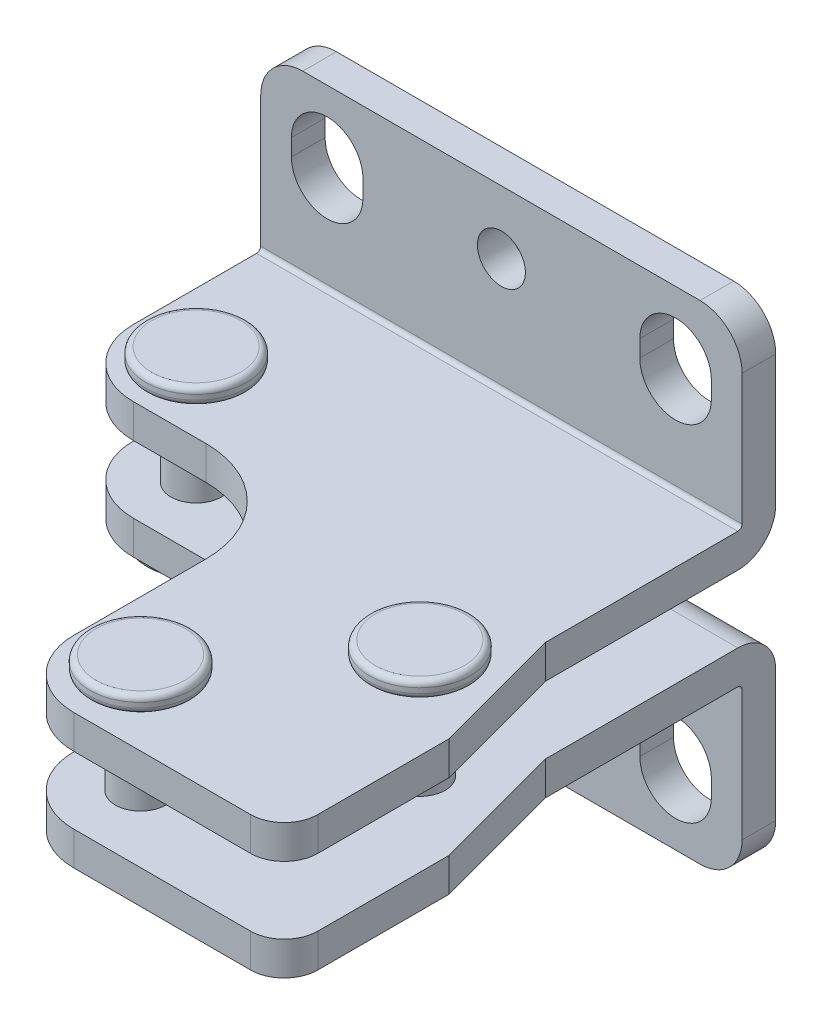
ISO-10303-21;
HEADER;
FILE_DESCRIPTION(('STEP AP214'),'2;1');
FILE_NAME('part.step','',(''),(''),'','','');
FILE_SCHEMA(('AUTOMOTIVE_DESIGN { 1 0 10303 214 1 1 1 1 }'));
ENDSEC;
DATA;
#1=APPLICATION_CONTEXT('core data for automotive mechanical design processes');
#2=APPLICATION_PROTOCOL_DEFINITION('international standard','automotive_design',2000,#1);
#3=PRODUCT_CONTEXT('',#1,'mechanical');
#4=PRODUCT('Part','Part','',(#3));
#5=PRODUCT_RELATED_PRODUCT_CATEGORY('part','',(#4));
#6=PRODUCT_DEFINITION_FORMATION('','',#4);
#7=PRODUCT_DEFINITION_CONTEXT('part definition',#1,'design');
#8=PRODUCT_DEFINITION('design','',#6,#7);
#9=PRODUCT_DEFINITION_SHAPE('','',#8);
#10=(LENGTH_UNIT() NAMED_UNIT(*) SI_UNIT(.MILLI.,.METRE.));
#11=(NAMED_UNIT(*) PLANE_ANGLE_UNIT() SI_UNIT($,.RADIAN.));
#12=(NAMED_UNIT(*) SI_UNIT($,.STERADIAN.) SOLID_ANGLE_UNIT());
#13=UNCERTAINTY_MEASURE_WITH_UNIT(LENGTH_MEASURE(1.E-05),#10,'distance_accuracy_value','');
#14=(GEOMETRIC_REPRESENTATION_CONTEXT(3) GLOBAL_UNCERTAINTY_ASSIGNED_CONTEXT((#13)) GLOBAL_UNIT_ASSIGNED_CONTEXT((#10,
#11,#12)) REPRESENTATION_CONTEXT('',''));
#15=CARTESIAN_POINT('',(0.,0.,0.));
#16=DIRECTION('',(0.,0.,1.));
#17=DIRECTION('',(1.,0.,0.));
#18=AXIS2_PLACEMENT_3D('',#15,#16,#17);
#19=CARTESIAN_POINT('',(-2.9,17.5015045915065,-14.9284954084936));
#20=DIRECTION('',(0.,-1.,0.));
#21=DIRECTION('',(1.,0.,0.));
#22=AXIS2_PLACEMENT_3D('',#19,#20,#21);
#23=PLANE('',#22);
#24=CARTESIAN_POINT('',(28.4872000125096,17.5015045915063,54.6615045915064));
#25=DIRECTION('',(0.,-1.,0.));
#26=DIRECTION('',(1.,0.,0.));
#27=AXIS2_PLACEMENT_3D('',#24,#25,#26);
#28=CIRCLE('',#27,7.94);
#29=CARTESIAN_POINT('',(28.4872000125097,17.5015045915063,62.6015045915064));
#30=VERTEX_POINT('',#29);
#31=CARTESIAN_POINT('',(20.5472000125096,17.5015045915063,54.6615045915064));
#32=VERTEX_POINT('',#31);
#33=EDGE_CURVE('E479',#30,#32,#28,.T.);
#34=ORIENTED_EDGE('',*,*,#33,.F.);
#35=DIRECTION('',(1.,0.,0.));
#36=VECTOR('',#35,1.);
#37=CARTESIAN_POINT('',(49.491,17.5015045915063,62.6015045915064));
#38=LINE('',#37,#36);
#39=CARTESIAN_POINT('',(49.491,17.5015045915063,62.6015045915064));
#40=VERTEX_POINT('',#39);
#41=EDGE_CURVE('E1176',#40,#30,#38,.F.);
#42=ORIENTED_EDGE('',*,*,#41,.F.);
#43=CARTESIAN_POINT('',(49.491,17.5015045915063,58.6015045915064));
#44=DIRECTION('',(0.,-1.,0.));
#45=DIRECTION('',(1.,0.,0.));
#46=AXIS2_PLACEMENT_3D('',#43,#44,#45);
#47=CIRCLE('',#46,4.);
#48=CARTESIAN_POINT('',(53.491,17.5015045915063,58.6015045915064));
#49=VERTEX_POINT('',#48);
#50=EDGE_CURVE('E483',#49,#40,#47,.T.);
#51=ORIENTED_EDGE('',*,*,#50,.F.);
#52=DIRECTION('',(0.,0.,1.));
#53=VECTOR('',#52,1.);
#54=CARTESIAN_POINT('',(53.491,17.5015045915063,43.0215045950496));
#55=LINE('',#54,#53);
#56=CARTESIAN_POINT('',(53.491,17.5015045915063,43.0215045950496));
#57=VERTEX_POINT('',#56);
#58=EDGE_CURVE('E1181',#57,#49,#55,.T.);
#59=ORIENTED_EDGE('',*,*,#58,.F.);
#60=DIRECTION('',(0.258819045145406,0.,0.965925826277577));
#61=VECTOR('',#60,1.);
#62=CARTESIAN_POINT('',(49.3,17.5015045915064,27.3804796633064));
#63=LINE('',#62,#61);
#64=CARTESIAN_POINT('',(49.3,17.5015045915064,27.3804796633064));
#65=VERTEX_POINT('',#64);
#66=EDGE_CURVE('E1185',#65,#57,#63,.T.);
#67=ORIENTED_EDGE('',*,*,#66,.F.);
#68=DIRECTION('',(0.,0.,1.));
#69=VECTOR('',#68,1.);
#70=CARTESIAN_POINT('',(49.3,17.5015045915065,-14.9284954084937));
#71=LINE('',#70,#69);
#72=CARTESIAN_POINT('',(49.3,17.5015045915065,4.5));
#73=VERTEX_POINT('',#72);
#74=EDGE_CURVE('E489',#73,#65,#71,.T.);
#75=ORIENTED_EDGE('',*,*,#74,.F.);
#76=DIRECTION('',(1.,0.,0.));
#77=VECTOR('',#76,1.);
#78=CARTESIAN_POINT('',(-2.9,17.5015045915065,4.5));
#79=LINE('',#78,#77);
#80=CARTESIAN_POINT('',(-7.89999999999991,17.5015045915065,4.5));
#81=VERTEX_POINT('',#80);
#82=EDGE_CURVE('E493',#81,#73,#79,.T.);
#83=ORIENTED_EDGE('',*,*,#82,.F.);
#84=DIRECTION('',(0.,0.,1.));
#85=VECTOR('',#84,1.);
#86=CARTESIAN_POINT('',(-7.89999999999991,17.5015045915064,19.1328045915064));
#87=LINE('',#86,#85);
#88=CARTESIAN_POINT('',(-7.89999999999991,17.5015045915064,19.1328045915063));
#89=VERTEX_POINT('',#88);
#90=EDGE_CURVE('E1160',#89,#81,#87,.F.);
#91=ORIENTED_EDGE('',*,*,#90,.F.);
#92=CARTESIAN_POINT('',(0.0375000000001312,17.5015045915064,19.1328045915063));
#93=DIRECTION('',(0.,-1.,0.));
#94=DIRECTION('',(1.,0.,0.));
#95=AXIS2_PLACEMENT_3D('',#92,#93,#94);
#96=CIRCLE('',#95,7.9375);
#97=CARTESIAN_POINT('',(0.0370609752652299,17.5015045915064,27.0703045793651));
#98=VERTEX_POINT('',#97);
#99=EDGE_CURVE('E471',#98,#89,#96,.T.);
#100=ORIENTED_EDGE('',*,*,#99,.F.);
#101=DIRECTION('',(-1.,0.,0.));
#102=VECTOR('',#101,1.);
#103=CARTESIAN_POINT('',(8.64095,17.5015045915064,27.0703045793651));
#104=LINE('',#103,#102);
#105=CARTESIAN_POINT('',(8.64095,17.5015045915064,27.0703045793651));
#106=VERTEX_POINT('',#105);
#107=EDGE_CURVE('E1167',#106,#98,#104,.T.);
#108=ORIENTED_EDGE('',*,*,#107,.F.);
#109=CARTESIAN_POINT('',(8.64095,17.5015045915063,38.9765545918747));
#110=DIRECTION('',(0.,-1.,0.));
#111=DIRECTION('',(1.,0.,0.));
#112=AXIS2_PLACEMENT_3D('',#109,#110,#111);
#113=CIRCLE('',#112,11.9062500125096);
#114=CARTESIAN_POINT('',(20.5472000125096,17.5015045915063,38.9765545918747));
#115=VERTEX_POINT('',#114);
#116=EDGE_CURVE('E475',#106,#115,#113,.T.);
#117=ORIENTED_EDGE('',*,*,#116,.T.);
#118=DIRECTION('',(0.,0.,1.));
#119=VECTOR('',#118,1.);
#120=CARTESIAN_POINT('',(20.5472000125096,17.5015045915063,54.6615045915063));
#121=LINE('',#120,#119);
#122=EDGE_CURVE('E478',#32,#115,#121,.F.);
#123=ORIENTED_EDGE('',*,*,#122,.F.);
#124=EDGE_LOOP('',(#34,#42,#51,#59,#67,#75,#83,#91,#100,#108,#117,#123));
#125=FACE_BOUND('',#124,.T.);
#126=CARTESIAN_POINT('',(43.5691250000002,17.5015045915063,36.5565045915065));
#127=DIRECTION('',(0.,-1.,0.));
#128=DIRECTION('',(1.,0.,0.));
#129=AXIS2_PLACEMENT_3D('',#126,#127,#128);
#130=CIRCLE('',#129,3.);
#131=CARTESIAN_POINT('',(46.5691250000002,17.5015045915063,36.5565045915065));
#132=VERTEX_POINT('',#131);
#133=EDGE_CURVE('E763',#132,#132,#130,.F.);
#134=ORIENTED_EDGE('',*,*,#133,.F.);
#135=EDGE_LOOP('',(#134));
#136=FACE_BOUND('',#135,.T.);
#137=CARTESIAN_POINT('',(28.4847000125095,17.5015045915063,54.6615045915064));
#138=DIRECTION('',(0.,1.,0.));
#139=DIRECTION('',(0.,0.,1.));
#140=AXIS2_PLACEMENT_3D('',#137,#138,#139);
#141=CIRCLE('',#140,3.);
#142=CARTESIAN_POINT('',(28.4847000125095,17.5015045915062,57.6615045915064));
#143=VERTEX_POINT('',#142);
#144=EDGE_CURVE('E1556',#143,#143,#141,.T.);
#145=ORIENTED_EDGE('',*,*,#144,.F.);
#146=EDGE_LOOP('',(#145));
#147=FACE_BOUND('',#146,.T.);
#148=CARTESIAN_POINT('',(0.0875000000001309,17.5015045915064,19.6603045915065));
#149=DIRECTION('',(0.,1.,0.));
#150=DIRECTION('',(0.,0.,1.));
#151=AXIS2_PLACEMENT_3D('',#148,#149,#150);
#152=CIRCLE('',#151,3.);
#153=CARTESIAN_POINT('',(0.0875000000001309,17.5015045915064,22.6603045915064));
#154=VERTEX_POINT('',#153);
#155=EDGE_CURVE('E1551',#154,#154,#152,.T.);
#156=ORIENTED_EDGE('',*,*,#155,.F.);
#157=EDGE_LOOP('',(#156));
#158=FACE_BOUND('',#157,.T.);
#159=ADVANCED_FACE('F14',(#125,#136,#147,#158),#23,.F.);
#160=CARTESIAN_POINT('',(-2.9,25.5015045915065,-14.9284954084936));
#161=DIRECTION('',(0.,-1.,0.));
#162=DIRECTION('',(1.,0.,0.));
#163=AXIS2_PLACEMENT_3D('',#160,#161,#162);
#164=PLANE('',#163);
#165=CARTESIAN_POINT('',(8.64095,25.5015045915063,38.9765545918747));
#166=DIRECTION('',(0.,-1.,0.));
#167=DIRECTION('',(1.,0.,0.));
#168=AXIS2_PLACEMENT_3D('',#165,#166,#167);
#169=CIRCLE('',#168,11.9062500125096);
#170=CARTESIAN_POINT('',(20.5472000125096,25.5015045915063,38.9765545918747));
#171=VERTEX_POINT('',#170);
#172=CARTESIAN_POINT('',(8.64095,25.5015045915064,27.0703045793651));
#173=VERTEX_POINT('',#172);
#174=EDGE_CURVE('E933',#171,#173,#169,.F.);
#175=ORIENTED_EDGE('',*,*,#174,.T.);
#176=DIRECTION('',(1.,0.,0.));
#177=VECTOR('',#176,1.);
#178=CARTESIAN_POINT('',(-2.9,25.5015045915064,27.0703045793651));
#179=LINE('',#178,#177);
#180=CARTESIAN_POINT('',(0.0370609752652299,25.5015045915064,27.0703045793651));
#181=VERTEX_POINT('',#180);
#182=EDGE_CURVE('E926',#173,#181,#179,.F.);
#183=ORIENTED_EDGE('',*,*,#182,.T.);
#184=CARTESIAN_POINT('',(0.0375000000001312,25.5015045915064,19.1328045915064));
#185=DIRECTION('',(0.,-1.,0.));
#186=DIRECTION('',(1.,0.,0.));
#187=AXIS2_PLACEMENT_3D('',#184,#185,#186);
#188=CIRCLE('',#187,7.9375);
#189=CARTESIAN_POINT('',(-7.89999999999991,25.5015045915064,19.1328045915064));
#190=VERTEX_POINT('',#189);
#191=EDGE_CURVE('E919',#181,#190,#188,.T.);
#192=ORIENTED_EDGE('',*,*,#191,.T.);
#193=DIRECTION('',(0.,0.,1.));
#194=VECTOR('',#193,1.);
#195=CARTESIAN_POINT('',(-7.89999999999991,25.5015045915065,-14.9284954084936));
#196=LINE('',#195,#194);
#197=CARTESIAN_POINT('',(-7.89999999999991,25.5015045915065,4.50000000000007));
#198=VERTEX_POINT('',#197);
#199=EDGE_CURVE('E918',#190,#198,#196,.F.);
#200=ORIENTED_EDGE('',*,*,#199,.T.);
#201=DIRECTION('',(1.,0.,0.));
#202=VECTOR('',#201,1.);
#203=CARTESIAN_POINT('',(-2.9,25.5015045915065,4.50000000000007));
#204=LINE('',#203,#202);
#205=CARTESIAN_POINT('',(49.3,25.5015045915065,4.50000000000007));
#206=VERTEX_POINT('',#205);
#207=EDGE_CURVE('E952',#198,#206,#204,.T.);
#208=ORIENTED_EDGE('',*,*,#207,.T.);
#209=DIRECTION('',(0.,0.,1.));
#210=VECTOR('',#209,1.);
#211=CARTESIAN_POINT('',(49.3,25.5015045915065,-14.9284954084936));
#212=LINE('',#211,#210);
#213=CARTESIAN_POINT('',(49.3,25.5015045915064,27.3804796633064));
#214=VERTEX_POINT('',#213);
#215=EDGE_CURVE('E954',#206,#214,#212,.T.);
#216=ORIENTED_EDGE('',*,*,#215,.T.);
#217=DIRECTION('',(0.2588190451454,0.,0.965925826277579));
#218=VECTOR('',#217,1.);
#219=CARTESIAN_POINT('',(49.3,25.5015045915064,27.3804796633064));
#220=LINE('',#219,#218);
#221=CARTESIAN_POINT('',(53.491,25.5015045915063,43.0215045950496));
#222=VERTEX_POINT('',#221);
#223=EDGE_CURVE('E944',#214,#222,#220,.T.);
#224=ORIENTED_EDGE('',*,*,#223,.T.);
#225=DIRECTION('',(0.,0.,1.));
#226=VECTOR('',#225,1.);
#227=CARTESIAN_POINT('',(53.491,25.5015045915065,-14.9284954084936));
#228=LINE('',#227,#226);
#229=CARTESIAN_POINT('',(53.491,25.5015045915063,58.6015045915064));
#230=VERTEX_POINT('',#229);
#231=EDGE_CURVE('E941',#222,#230,#228,.T.);
#232=ORIENTED_EDGE('',*,*,#231,.T.);
#233=CARTESIAN_POINT('',(49.491,25.5015045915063,58.6015045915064));
#234=DIRECTION('',(0.,-1.,0.));
#235=DIRECTION('',(1.,0.,0.));
#236=AXIS2_PLACEMENT_3D('',#233,#234,#235);
#237=CIRCLE('',#236,4.);
#238=CARTESIAN_POINT('',(49.491,25.5015045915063,62.6015045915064));
#239=VERTEX_POINT('',#238);
#240=EDGE_CURVE('E940',#230,#239,#237,.T.);
#241=ORIENTED_EDGE('',*,*,#240,.T.);
#242=DIRECTION('',(1.,0.,0.));
#243=VECTOR('',#242,1.);
#244=CARTESIAN_POINT('',(-2.9,25.5015045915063,62.6015045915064));
#245=LINE('',#244,#243);
#246=CARTESIAN_POINT('',(28.4872000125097,25.5015045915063,62.6015045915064));
#247=VERTEX_POINT('',#246);
#248=EDGE_CURVE('E938',#239,#247,#245,.F.);
#249=ORIENTED_EDGE('',*,*,#248,.T.);
#250=CARTESIAN_POINT('',(28.4872000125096,25.5015045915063,54.6615045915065));
#251=DIRECTION('',(0.,-1.,0.));
#252=DIRECTION('',(1.,0.,0.));
#253=AXIS2_PLACEMENT_3D('',#250,#251,#252);
#254=CIRCLE('',#253,7.94);
#255=CARTESIAN_POINT('',(20.5472000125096,25.5015045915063,54.6615045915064));
#256=VERTEX_POINT('',#255);
#257=EDGE_CURVE('E937',#247,#256,#254,.T.);
#258=ORIENTED_EDGE('',*,*,#257,.T.);
#259=DIRECTION('',(0.,0.,1.));
#260=VECTOR('',#259,1.);
#261=CARTESIAN_POINT('',(20.5472000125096,25.5015045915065,-14.9284954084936));
#262=LINE('',#261,#260);
#263=EDGE_CURVE('E934',#256,#171,#262,.F.);
#264=ORIENTED_EDGE('',*,*,#263,.T.);
#265=EDGE_LOOP('',(#175,#183,#192,#200,#208,#216,#224,#232,#241,#249,#258,#264));
#266=FACE_BOUND('',#265,.T.);
#267=CARTESIAN_POINT('',(43.5691250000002,25.5015045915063,36.5565045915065));
#268=DIRECTION('',(0.,-1.,0.));
#269=DIRECTION('',(1.,0.,0.));
#270=AXIS2_PLACEMENT_3D('',#267,#268,#269);
#271=CIRCLE('',#270,3.);
#272=CARTESIAN_POINT('',(46.5691250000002,25.5015045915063,36.5565045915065));
#273=VERTEX_POINT('',#272);
#274=EDGE_CURVE('E755',#273,#273,#271,.F.);
#275=ORIENTED_EDGE('',*,*,#274,.T.);
#276=EDGE_LOOP('',(#275));
#277=FACE_BOUND('',#276,.T.);
#278=CARTESIAN_POINT('',(28.4847000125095,25.5015045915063,54.6615045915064));
#279=DIRECTION('',(0.,-1.,0.));
#280=DIRECTION('',(0.,0.,-1.));
#281=AXIS2_PLACEMENT_3D('',#278,#279,#280);
#282=CIRCLE('',#281,3.);
#283=CARTESIAN_POINT('',(28.4847000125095,25.5015045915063,51.6615045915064));
#284=VERTEX_POINT('',#283);
#285=EDGE_CURVE('E1547',#284,#284,#282,.T.);
#286=ORIENTED_EDGE('',*,*,#285,.F.);
#287=EDGE_LOOP('',(#286));
#288=FACE_BOUND('',#287,.T.);
#289=CARTESIAN_POINT('',(0.0875000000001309,25.5015045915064,19.6603045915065));
#290=DIRECTION('',(0.,-1.,0.));
#291=DIRECTION('',(0.,0.,-1.));
#292=AXIS2_PLACEMENT_3D('',#289,#290,#291);
#293=CIRCLE('',#292,3.);
#294=CARTESIAN_POINT('',(0.0875000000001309,25.5015045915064,16.6603045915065));
#295=VERTEX_POINT('',#294);
#296=EDGE_CURVE('E542',#295,#295,#293,.T.);
#297=ORIENTED_EDGE('',*,*,#296,.F.);
#298=EDGE_LOOP('',(#297));
#299=FACE_BOUND('',#298,.T.);
#300=ADVANCED_FACE('F1281',(#266,#277,#288,#299),#164,.T.);
#301=CARTESIAN_POINT('',(0.0875000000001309,31.5015045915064,19.6603045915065));
#302=DIRECTION('',(0.,-1.,0.));
#303=DIRECTION('',(1.,0.,0.));
#304=AXIS2_PLACEMENT_3D('',#301,#302,#303);
#305=PLANE('',#304);
#306=CARTESIAN_POINT('',(0.0875000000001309,31.5015045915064,19.6603045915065));
#307=DIRECTION('',(0.,-1.,0.));
#308=DIRECTION('',(1.,0.,0.));
#309=AXIS2_PLACEMENT_3D('',#306,#307,#308);
#310=CIRCLE('',#309,5.29999999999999);
#311=CARTESIAN_POINT('',(5.38750000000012,31.5015045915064,19.6603045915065));
#312=VERTEX_POINT('',#311);
#313=CARTESIAN_POINT('',(-5.21249999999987,31.5015045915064,19.6603045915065));
#314=VERTEX_POINT('',#313);
#315=EDGE_CURVE('E1600',#312,#314,#310,.T.);
#316=ORIENTED_EDGE('',*,*,#315,.F.);
#317=CARTESIAN_POINT('',(0.0875000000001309,31.5015045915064,19.6603045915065));
#318=DIRECTION('',(0.,-1.,0.));
#319=DIRECTION('',(-1.,0.,0.));
#320=AXIS2_PLACEMENT_3D('',#317,#318,#319);
#321=CIRCLE('',#320,5.29999999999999);
#322=EDGE_CURVE('E1633',#314,#312,#321,.T.);
#323=ORIENTED_EDGE('',*,*,#322,.F.);
#324=EDGE_LOOP('',(#316,#323));
#325=FACE_BOUND('',#324,.T.);
#326=ADVANCED_FACE('F624',(#325),#305,.F.);
#327=CARTESIAN_POINT('',(28.4847000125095,31.5015045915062,54.6615045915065));
#328=DIRECTION('',(0.,-1.,0.));
#329=DIRECTION('',(1.,0.,0.));
#330=AXIS2_PLACEMENT_3D('',#327,#328,#329);
#331=PLANE('',#330);
#332=CARTESIAN_POINT('',(28.4847000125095,31.5015045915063,54.6615045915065));
#333=DIRECTION('',(0.,-1.,0.));
#334=DIRECTION('',(1.,0.,0.));
#335=AXIS2_PLACEMENT_3D('',#332,#333,#334);
#336=CIRCLE('',#335,5.3);
#337=CARTESIAN_POINT('',(33.7847000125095,31.5015045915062,54.6615045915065));
#338=VERTEX_POINT('',#337);
#339=CARTESIAN_POINT('',(23.1847000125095,31.5015045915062,54.6615045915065));
#340=VERTEX_POINT('',#339);
#341=EDGE_CURVE('E814',#338,#340,#336,.T.);
#342=ORIENTED_EDGE('',*,*,#341,.F.);
#343=CARTESIAN_POINT('',(28.4847000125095,31.5015045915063,54.6615045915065));
#344=DIRECTION('',(0.,-1.,0.));
#345=DIRECTION('',(-1.,0.,0.));
#346=AXIS2_PLACEMENT_3D('',#343,#344,#345);
#347=CIRCLE('',#346,5.3);
#348=EDGE_CURVE('E851',#340,#338,#347,.T.);
#349=ORIENTED_EDGE('',*,*,#348,.F.);
#350=EDGE_LOOP('',(#342,#349));
#351=FACE_BOUND('',#350,.T.);
#352=ADVANCED_FACE('F832',(#351),#331,.F.);
#353=CARTESIAN_POINT('',(43.5691250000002,31.5015045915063,36.5565045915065));
#354=DIRECTION('',(0.,-1.,0.));
#355=DIRECTION('',(1.,0.,0.));
#356=AXIS2_PLACEMENT_3D('',#353,#354,#355);
#357=PLANE('',#356);
#358=CARTESIAN_POINT('',(43.5691250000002,31.5015045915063,36.5565045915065));
#359=DIRECTION('',(0.,-1.,0.));
#360=DIRECTION('',(1.,0.,0.));
#361=AXIS2_PLACEMENT_3D('',#358,#359,#360);
#362=CIRCLE('',#361,5.29999999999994);
#363=CARTESIAN_POINT('',(48.8691250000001,31.5015045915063,36.5565045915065));
#364=VERTEX_POINT('',#363);
#365=CARTESIAN_POINT('',(38.2691250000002,31.5015045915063,36.5565045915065));
#366=VERTEX_POINT('',#365);
#367=EDGE_CURVE('E1390',#364,#366,#362,.T.);
#368=ORIENTED_EDGE('',*,*,#367,.F.);
#369=CARTESIAN_POINT('',(43.5691250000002,31.5015045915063,36.5565045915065));
#370=DIRECTION('',(0.,-1.,0.));
#371=DIRECTION('',(-1.,0.,0.));
#372=AXIS2_PLACEMENT_3D('',#369,#370,#371);
#373=CIRCLE('',#372,5.29999999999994);
#374=EDGE_CURVE('E1388',#366,#364,#373,.T.);
#375=ORIENTED_EDGE('',*,*,#374,.F.);
#376=EDGE_LOOP('',(#368,#375));
#377=FACE_BOUND('',#376,.T.);
#378=ADVANCED_FACE('F729',(#377),#357,.F.);
#379=CARTESIAN_POINT('',(28.4847000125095,11.5015045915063,54.6615045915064));
#380=DIRECTION('',(0.,1.,0.));
#381=DIRECTION('',(-1.,0.,0.));
#382=AXIS2_PLACEMENT_3D('',#379,#380,#381);
#383=PLANE('',#382);
#384=CARTESIAN_POINT('',(28.4847000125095,11.5015045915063,54.6615045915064));
#385=DIRECTION('',(0.,1.,0.));
#386=DIRECTION('',(-1.,0.,0.));
#387=AXIS2_PLACEMENT_3D('',#384,#385,#386);
#388=CIRCLE('',#387,5.3);
#389=CARTESIAN_POINT('',(23.1847000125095,11.5015045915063,54.6615045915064));
#390=VERTEX_POINT('',#389);
#391=CARTESIAN_POINT('',(33.7847000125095,11.5015045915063,54.6615045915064));
#392=VERTEX_POINT('',#391);
#393=EDGE_CURVE('E889',#390,#392,#388,.T.);
#394=ORIENTED_EDGE('',*,*,#393,.F.);
#395=CARTESIAN_POINT('',(28.4847000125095,11.5015045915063,54.6615045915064));
#396=DIRECTION('',(0.,1.,0.));
#397=DIRECTION('',(1.,0.,0.));
#398=AXIS2_PLACEMENT_3D('',#395,#396,#397);
#399=CIRCLE('',#398,5.3);
#400=EDGE_CURVE('E900',#392,#390,#399,.T.);
#401=ORIENTED_EDGE('',*,*,#400,.F.);
#402=EDGE_LOOP('',(#394,#401));
#403=FACE_BOUND('',#402,.T.);
#404=ADVANCED_FACE('F625',(#403),#383,.F.);
#405=CARTESIAN_POINT('',(43.5691250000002,11.5015045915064,36.5565045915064));
#406=DIRECTION('',(0.,1.,0.));
#407=DIRECTION('',(-1.,0.,0.));
#408=AXIS2_PLACEMENT_3D('',#405,#406,#407);
#409=PLANE('',#408);
#410=CARTESIAN_POINT('',(43.5691250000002,11.5015045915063,36.5565045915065));
#411=DIRECTION('',(0.,1.,0.));
#412=DIRECTION('',(-1.,0.,0.));
#413=AXIS2_PLACEMENT_3D('',#410,#411,#412);
#414=CIRCLE('',#413,5.3);
#415=CARTESIAN_POINT('',(38.2691250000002,11.5015045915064,36.5565045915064));
#416=VERTEX_POINT('',#415);
#417=CARTESIAN_POINT('',(48.8691250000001,11.5015045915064,36.5565045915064));
#418=VERTEX_POINT('',#417);
#419=EDGE_CURVE('E750',#416,#418,#414,.T.);
#420=ORIENTED_EDGE('',*,*,#419,.F.);
#421=CARTESIAN_POINT('',(43.5691250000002,11.5015045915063,36.5565045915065));
#422=DIRECTION('',(0.,1.,0.));
#423=DIRECTION('',(1.,0.,0.));
#424=AXIS2_PLACEMENT_3D('',#421,#422,#423);
#425=CIRCLE('',#424,5.3);
#426=EDGE_CURVE('E1394',#418,#416,#425,.T.);
#427=ORIENTED_EDGE('',*,*,#426,.F.);
#428=EDGE_LOOP('',(#420,#427));
#429=FACE_BOUND('',#428,.T.);
#430=ADVANCED_FACE('F780',(#429),#409,.F.);
#431=CARTESIAN_POINT('',(0.0875000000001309,11.5015045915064,19.6603045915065));
#432=DIRECTION('',(0.,1.,0.));
#433=DIRECTION('',(-1.,0.,0.));
#434=AXIS2_PLACEMENT_3D('',#431,#432,#433);
#435=PLANE('',#434);
#436=CARTESIAN_POINT('',(0.0875000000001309,11.5015045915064,19.6603045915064));
#437=DIRECTION('',(0.,1.,0.));
#438=DIRECTION('',(-1.,0.,0.));
#439=AXIS2_PLACEMENT_3D('',#436,#437,#438);
#440=CIRCLE('',#439,5.3);
#441=CARTESIAN_POINT('',(-5.21249999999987,11.5015045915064,19.6603045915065));
#442=VERTEX_POINT('',#441);
#443=CARTESIAN_POINT('',(5.38750000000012,11.5015045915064,19.6603045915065));
#444=VERTEX_POINT('',#443);
#445=EDGE_CURVE('E767',#442,#444,#440,.T.);
#446=ORIENTED_EDGE('',*,*,#445,.F.);
#447=CARTESIAN_POINT('',(0.0875000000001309,11.5015045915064,19.6603045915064));
#448=DIRECTION('',(0.,1.,0.));
#449=DIRECTION('',(1.,0.,0.));
#450=AXIS2_PLACEMENT_3D('',#447,#448,#449);
#451=CIRCLE('',#450,5.3);
#452=EDGE_CURVE('E1677',#444,#442,#451,.T.);
#453=ORIENTED_EDGE('',*,*,#452,.F.);
#454=EDGE_LOOP('',(#446,#453));
#455=FACE_BOUND('',#454,.T.);
#456=ADVANCED_FACE('F1446',(#455),#435,.F.);
#457=CARTESIAN_POINT('',(0.0875000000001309,30.8015045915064,19.6603045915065));
#458=DIRECTION('',(0.,-1.,0.));
#459=DIRECTION('',(1.,0.,0.));
#460=AXIS2_PLACEMENT_3D('',#457,#458,#459);
#461=TOROIDAL_SURFACE('',#460,5.29999999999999,0.7);
#462=ORIENTED_EDGE('',*,*,#315,.T.);
#463=ORIENTED_EDGE('',*,*,#322,.T.);
#464=EDGE_LOOP('',(#462,#463));
#465=FACE_BOUND('',#464,.T.);
#466=CARTESIAN_POINT('',(0.0875000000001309,30.8015045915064,19.6603045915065));
#467=DIRECTION('',(0.,1.,0.));
#468=DIRECTION('',(-1.,0.,0.));
#469=AXIS2_PLACEMENT_3D('',#466,#467,#468);
#470=CIRCLE('',#469,6.);
#471=CARTESIAN_POINT('',(-5.91249999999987,30.8015045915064,19.6603045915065));
#472=VERTEX_POINT('',#471);
#473=EDGE_CURVE('E1626',#472,#472,#470,.F.);
#474=ORIENTED_EDGE('',*,*,#473,.F.);
#475=EDGE_LOOP('',(#474));
#476=FACE_BOUND('',#475,.T.);
#477=ADVANCED_FACE('F831',(#465,#476),#461,.T.);
#478=CARTESIAN_POINT('',(28.4847000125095,30.8015045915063,54.6615045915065));
#479=DIRECTION('',(0.,-1.,0.));
#480=DIRECTION('',(1.,0.,0.));
#481=AXIS2_PLACEMENT_3D('',#478,#479,#480);
#482=TOROIDAL_SURFACE('',#481,5.3,0.7);
#483=ORIENTED_EDGE('',*,*,#341,.T.);
#484=ORIENTED_EDGE('',*,*,#348,.T.);
#485=EDGE_LOOP('',(#483,#484));
#486=FACE_BOUND('',#485,.T.);
#487=CARTESIAN_POINT('',(28.4847000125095,30.8015045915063,54.6615045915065));
#488=DIRECTION('',(0.,1.,0.));
#489=DIRECTION('',(-1.,0.,0.));
#490=AXIS2_PLACEMENT_3D('',#487,#488,#489);
#491=CIRCLE('',#490,6.);
#492=CARTESIAN_POINT('',(22.4847000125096,30.8015045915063,54.6615045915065));
#493=VERTEX_POINT('',#492);
#494=EDGE_CURVE('E844',#493,#493,#491,.F.);
#495=ORIENTED_EDGE('',*,*,#494,.F.);
#496=EDGE_LOOP('',(#495));
#497=FACE_BOUND('',#496,.T.);
#498=ADVANCED_FACE('F727',(#486,#497),#482,.T.);
#499=CARTESIAN_POINT('',(43.5691250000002,30.8015045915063,36.5565045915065));
#500=DIRECTION('',(0.,-1.,0.));
#501=DIRECTION('',(1.,0.,0.));
#502=AXIS2_PLACEMENT_3D('',#499,#500,#501);
#503=TOROIDAL_SURFACE('',#502,5.29999999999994,0.7);
#504=ORIENTED_EDGE('',*,*,#367,.T.);
#505=ORIENTED_EDGE('',*,*,#374,.T.);
#506=EDGE_LOOP('',(#504,#505));
#507=FACE_BOUND('',#506,.T.);
#508=CARTESIAN_POINT('',(43.5691250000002,30.8015045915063,36.5565045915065));
#509=DIRECTION('',(0.,1.,0.));
#510=DIRECTION('',(-1.,0.,0.));
#511=AXIS2_PLACEMENT_3D('',#508,#509,#510);
#512=CIRCLE('',#511,6.);
#513=CARTESIAN_POINT('',(37.5691250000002,30.8015045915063,36.5565045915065));
#514=VERTEX_POINT('',#513);
#515=EDGE_CURVE('E717',#514,#514,#512,.F.);
#516=ORIENTED_EDGE('',*,*,#515,.F.);
#517=EDGE_LOOP('',(#516));
#518=FACE_BOUND('',#517,.T.);
#519=ADVANCED_FACE('F722',(#507,#518),#503,.T.);
#520=CARTESIAN_POINT('',(28.4847000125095,12.2015045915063,54.6615045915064));
#521=DIRECTION('',(0.,1.,0.));
#522=DIRECTION('',(-1.,0.,0.));
#523=AXIS2_PLACEMENT_3D('',#520,#521,#522);
#524=TOROIDAL_SURFACE('',#523,5.3,0.7);
#525=ORIENTED_EDGE('',*,*,#393,.T.);
#526=ORIENTED_EDGE('',*,*,#400,.T.);
#527=EDGE_LOOP('',(#525,#526));
#528=FACE_BOUND('',#527,.T.);
#529=CARTESIAN_POINT('',(28.4847000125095,12.2015045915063,54.6615045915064));
#530=DIRECTION('',(0.,-1.,0.));
#531=DIRECTION('',(1.,0.,0.));
#532=AXIS2_PLACEMENT_3D('',#529,#530,#531);
#533=CIRCLE('',#532,6.);
#534=CARTESIAN_POINT('',(34.4847000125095,12.2015045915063,54.6615045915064));
#535=VERTEX_POINT('',#534);
#536=EDGE_CURVE('E846',#535,#535,#533,.F.);
#537=ORIENTED_EDGE('',*,*,#536,.F.);
#538=EDGE_LOOP('',(#537));
#539=FACE_BOUND('',#538,.T.);
#540=ADVANCED_FACE('F726',(#528,#539),#524,.T.);
#541=CARTESIAN_POINT('',(43.5691250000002,12.2015045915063,36.5565045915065));
#542=DIRECTION('',(0.,1.,0.));
#543=DIRECTION('',(-1.,0.,0.));
#544=AXIS2_PLACEMENT_3D('',#541,#542,#543);
#545=TOROIDAL_SURFACE('',#544,5.3,0.7);
#546=ORIENTED_EDGE('',*,*,#419,.T.);
#547=ORIENTED_EDGE('',*,*,#426,.T.);
#548=EDGE_LOOP('',(#546,#547));
#549=FACE_BOUND('',#548,.T.);
#550=CARTESIAN_POINT('',(43.5691250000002,12.2015045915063,36.5565045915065));
#551=DIRECTION('',(0.,-1.,0.));
#552=DIRECTION('',(1.,0.,0.));
#553=AXIS2_PLACEMENT_3D('',#550,#551,#552);
#554=CIRCLE('',#553,6.);
#555=CARTESIAN_POINT('',(49.5691250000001,12.2015045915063,36.5565045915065));
#556=VERTEX_POINT('',#555);
#557=EDGE_CURVE('E1391',#556,#556,#554,.F.);
#558=ORIENTED_EDGE('',*,*,#557,.F.);
#559=EDGE_LOOP('',(#558));
#560=FACE_BOUND('',#559,.T.);
#561=ADVANCED_FACE('F730',(#549,#560),#545,.T.);
#562=CARTESIAN_POINT('',(0.0875000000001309,12.2015045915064,19.6603045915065));
#563=DIRECTION('',(0.,1.,0.));
#564=DIRECTION('',(-1.,0.,0.));
#565=AXIS2_PLACEMENT_3D('',#562,#563,#564);
#566=TOROIDAL_SURFACE('',#565,5.3,0.7);
#567=ORIENTED_EDGE('',*,*,#445,.T.);
#568=ORIENTED_EDGE('',*,*,#452,.T.);
#569=EDGE_LOOP('',(#567,#568));
#570=FACE_BOUND('',#569,.T.);
#571=CARTESIAN_POINT('',(0.0875000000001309,12.2015045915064,19.6603045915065));
#572=DIRECTION('',(0.,-1.,0.));
#573=DIRECTION('',(1.,0.,0.));
#574=AXIS2_PLACEMENT_3D('',#571,#572,#573);
#575=CIRCLE('',#574,6.);
#576=CARTESIAN_POINT('',(6.08750000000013,12.2015045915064,19.6603045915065));
#577=VERTEX_POINT('',#576);
#578=EDGE_CURVE('E1628',#577,#577,#575,.F.);
#579=ORIENTED_EDGE('',*,*,#578,.F.);
#580=EDGE_LOOP('',(#579));
#581=FACE_BOUND('',#580,.T.);
#582=ADVANCED_FACE('F1438',(#570,#581),#566,.T.);
#583=CARTESIAN_POINT('',(0.0875000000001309,29.5015045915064,19.6603045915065));
#584=DIRECTION('',(0.,1.,0.));
#585=DIRECTION('',(-1.,0.,0.));
#586=AXIS2_PLACEMENT_3D('',#583,#584,#585);
#587=CYLINDRICAL_SURFACE('',#586,6.);
#588=CARTESIAN_POINT('',(0.0875000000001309,30.2015045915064,19.6603045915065));
#589=DIRECTION('',(0.,-1.,0.));
#590=DIRECTION('',(1.,0.,0.));
#591=AXIS2_PLACEMENT_3D('',#588,#589,#590);
#592=CIRCLE('',#591,6.);
#593=CARTESIAN_POINT('',(6.08750000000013,30.2015045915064,19.6603045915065));
#594=VERTEX_POINT('',#593);
#595=EDGE_CURVE('E1719',#594,#594,#592,.T.);
#596=ORIENTED_EDGE('',*,*,#595,.F.);
#597=EDGE_LOOP('',(#596));
#598=FACE_BOUND('',#597,.T.);
#599=ORIENTED_EDGE('',*,*,#473,.T.);
#600=EDGE_LOOP('',(#599));
#601=FACE_BOUND('',#600,.T.);
#602=ADVANCED_FACE('F1443',(#598,#601),#587,.T.);
#603=CARTESIAN_POINT('',(28.4847000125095,29.5015045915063,54.6615045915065));
#604=DIRECTION('',(0.,1.,0.));
#605=DIRECTION('',(-1.,0.,0.));
#606=AXIS2_PLACEMENT_3D('',#603,#604,#605);
#607=CYLINDRICAL_SURFACE('',#606,6.);
#608=CARTESIAN_POINT('',(28.4847000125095,30.2015045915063,54.6615045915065));
#609=DIRECTION('',(0.,-1.,0.));
#610=DIRECTION('',(1.,0.,0.));
#611=AXIS2_PLACEMENT_3D('',#608,#609,#610);
#612=CIRCLE('',#611,6.);
#613=CARTESIAN_POINT('',(34.4847000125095,30.2015045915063,54.6615045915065));
#614=VERTEX_POINT('',#613);
#615=EDGE_CURVE('E1400',#614,#614,#612,.T.);
#616=ORIENTED_EDGE('',*,*,#615,.F.);
#617=EDGE_LOOP('',(#616));
#618=FACE_BOUND('',#617,.T.);
#619=ORIENTED_EDGE('',*,*,#494,.T.);
#620=EDGE_LOOP('',(#619));
#621=FACE_BOUND('',#620,.T.);
#622=ADVANCED_FACE('F779',(#618,#621),#607,.T.);
#623=CARTESIAN_POINT('',(43.5691250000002,29.5015045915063,36.5565045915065));
#624=DIRECTION('',(0.,1.,0.));
#625=DIRECTION('',(-1.,0.,0.));
#626=AXIS2_PLACEMENT_3D('',#623,#624,#625);
#627=CYLINDRICAL_SURFACE('',#626,6.);
#628=CARTESIAN_POINT('',(43.5691250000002,30.2015045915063,36.5565045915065));
#629=DIRECTION('',(0.,-1.,0.));
#630=DIRECTION('',(1.,0.,0.));
#631=AXIS2_PLACEMENT_3D('',#628,#629,#630);
#632=CIRCLE('',#631,6.);
#633=CARTESIAN_POINT('',(49.5691250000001,30.2015045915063,36.5565045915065));
#634=VERTEX_POINT('',#633);
#635=EDGE_CURVE('E666',#634,#634,#632,.T.);
#636=ORIENTED_EDGE('',*,*,#635,.F.);
#637=EDGE_LOOP('',(#636));
#638=FACE_BOUND('',#637,.T.);
#639=ORIENTED_EDGE('',*,*,#515,.T.);
#640=EDGE_LOOP('',(#639));
#641=FACE_BOUND('',#640,.T.);
#642=ADVANCED_FACE('F695',(#638,#641),#627,.T.);
#643=CARTESIAN_POINT('',(28.4847000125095,13.5015045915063,54.6615045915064));
#644=DIRECTION('',(0.,-1.,0.));
#645=DIRECTION('',(1.,0.,0.));
#646=AXIS2_PLACEMENT_3D('',#643,#644,#645);
#647=CYLINDRICAL_SURFACE('',#646,6.);
#648=CARTESIAN_POINT('',(28.4847000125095,12.8015045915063,54.6615045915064));
#649=DIRECTION('',(0.,1.,0.));
#650=DIRECTION('',(-1.,0.,0.));
#651=AXIS2_PLACEMENT_3D('',#648,#649,#650);
#652=CIRCLE('',#651,6.);
#653=CARTESIAN_POINT('',(22.4847000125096,12.8015045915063,54.6615045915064));
#654=VERTEX_POINT('',#653);
#655=EDGE_CURVE('E842',#654,#654,#652,.T.);
#656=ORIENTED_EDGE('',*,*,#655,.F.);
#657=EDGE_LOOP('',(#656));
#658=FACE_BOUND('',#657,.T.);
#659=ORIENTED_EDGE('',*,*,#536,.T.);
#660=EDGE_LOOP('',(#659));
#661=FACE_BOUND('',#660,.T.);
#662=ADVANCED_FACE('F833',(#658,#661),#647,.T.);
#663=CARTESIAN_POINT('',(43.5691250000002,13.5015045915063,36.5565045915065));
#664=DIRECTION('',(0.,-1.,0.));
#665=DIRECTION('',(1.,0.,0.));
#666=AXIS2_PLACEMENT_3D('',#663,#664,#665);
#667=CYLINDRICAL_SURFACE('',#666,6.);
#668=CARTESIAN_POINT('',(43.5691250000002,12.8015045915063,36.5565045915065));
#669=DIRECTION('',(0.,1.,0.));
#670=DIRECTION('',(-1.,0.,0.));
#671=AXIS2_PLACEMENT_3D('',#668,#669,#670);
#672=CIRCLE('',#671,6.);
#673=CARTESIAN_POINT('',(37.5691250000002,12.8015045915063,36.5565045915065));
#674=VERTEX_POINT('',#673);
#675=EDGE_CURVE('E714',#674,#674,#672,.T.);
#676=ORIENTED_EDGE('',*,*,#675,.F.);
#677=EDGE_LOOP('',(#676));
#678=FACE_BOUND('',#677,.T.);
#679=ORIENTED_EDGE('',*,*,#557,.T.);
#680=EDGE_LOOP('',(#679));
#681=FACE_BOUND('',#680,.T.);
#682=ADVANCED_FACE('F691',(#678,#681),#667,.T.);
#683=CARTESIAN_POINT('',(0.0875000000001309,13.5015045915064,19.6603045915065));
#684=DIRECTION('',(0.,-1.,0.));
#685=DIRECTION('',(1.,0.,0.));
#686=AXIS2_PLACEMENT_3D('',#683,#684,#685);
#687=CYLINDRICAL_SURFACE('',#686,6.);
#688=CARTESIAN_POINT('',(0.0875000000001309,12.8015045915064,19.6603045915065));
#689=DIRECTION('',(0.,1.,0.));
#690=DIRECTION('',(-1.,0.,0.));
#691=AXIS2_PLACEMENT_3D('',#688,#689,#690);
#692=CIRCLE('',#691,6.);
#693=CARTESIAN_POINT('',(-5.91249999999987,12.8015045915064,19.6603045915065));
#694=VERTEX_POINT('',#693);
#695=EDGE_CURVE('E1624',#694,#694,#692,.T.);
#696=ORIENTED_EDGE('',*,*,#695,.F.);
#697=EDGE_LOOP('',(#696));
#698=FACE_BOUND('',#697,.T.);
#699=ORIENTED_EDGE('',*,*,#578,.T.);
#700=EDGE_LOOP('',(#699));
#701=FACE_BOUND('',#700,.T.);
#702=ADVANCED_FACE('F1428',(#698,#701),#687,.T.);
#703=CARTESIAN_POINT('',(44.3,50.5030091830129,4.00000000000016));
#704=DIRECTION('',(0.,1.,0.));
#705=DIRECTION('',(0.,0.,1.));
#706=AXIS2_PLACEMENT_3D('',#703,#704,#705);
#707=PLANE('',#706);
#708=DIRECTION('',(1.,0.,0.));
#709=VECTOR('',#708,1.);
#710=CARTESIAN_POINT('',(44.3,50.5030091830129,4.00000000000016));
#711=LINE('',#710,#709);
#712=CARTESIAN_POINT('',(-2.9,50.5030091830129,4.00000000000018));
#713=VERTEX_POINT('',#712);
#714=CARTESIAN_POINT('',(44.3,50.5030091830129,4.00000000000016));
#715=VERTEX_POINT('',#714);
#716=EDGE_CURVE('E1066',#713,#715,#711,.T.);
#717=ORIENTED_EDGE('',*,*,#716,.T.);
#718=DIRECTION('',(0.,0.,-1.));
#719=VECTOR('',#718,1.);
#720=CARTESIAN_POINT('',(44.3,50.5030091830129,4.00000000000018));
#721=LINE('',#720,#719);
#722=CARTESIAN_POINT('',(44.3,50.5030091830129,1.83880688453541E-13));
#723=VERTEX_POINT('',#722);
#724=EDGE_CURVE('E1063',#723,#715,#721,.F.);
#725=ORIENTED_EDGE('',*,*,#724,.F.);
#726=DIRECTION('',(1.,0.,0.));
#727=VECTOR('',#726,1.);
#728=CARTESIAN_POINT('',(-2.9,50.5030091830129,1.83880688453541E-13));
#729=LINE('',#728,#727);
#730=CARTESIAN_POINT('',(-2.9,50.5030091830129,1.83880688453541E-13));
#731=VERTEX_POINT('',#730);
#732=EDGE_CURVE('E1025',#731,#723,#729,.T.);
#733=ORIENTED_EDGE('',*,*,#732,.F.);
#734=DIRECTION('',(0.,0.,1.));
#735=VECTOR('',#734,1.);
#736=CARTESIAN_POINT('',(-2.89999999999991,50.5030091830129,4.00000000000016));
#737=LINE('',#736,#735);
#738=EDGE_CURVE('E1067',#731,#713,#737,.T.);
#739=ORIENTED_EDGE('',*,*,#738,.T.);
#740=EDGE_LOOP('',(#717,#725,#733,#739));
#741=FACE_BOUND('',#740,.T.);
#742=ADVANCED_FACE('F1697',(#741),#707,.T.);
#743=CARTESIAN_POINT('',(20.7,43.0030091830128,4.00000000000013));
#744=DIRECTION('',(0.,0.,-1.));
#745=DIRECTION('',(0.,1.,0.));
#746=AXIS2_PLACEMENT_3D('',#743,#744,#745);
#747=CYLINDRICAL_SURFACE('',#746,2.85);
#748=CARTESIAN_POINT('',(20.7,43.0030091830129,1.38777878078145E-13));
#749=DIRECTION('',(0.,0.,-1.));
#750=DIRECTION('',(0.,1.,0.));
#751=AXIS2_PLACEMENT_3D('',#748,#749,#750);
#752=CIRCLE('',#751,2.85);
#753=CARTESIAN_POINT('',(20.7,45.8530091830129,1.58616523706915E-13));
#754=VERTEX_POINT('',#753);
#755=EDGE_CURVE('E1051',#754,#754,#752,.F.);
#756=ORIENTED_EDGE('',*,*,#755,.F.);
#757=EDGE_LOOP('',(#756));
#758=FACE_BOUND('',#757,.T.);
#759=CARTESIAN_POINT('',(20.7,43.0030091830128,4.00000000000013));
#760=DIRECTION('',(0.,0.,-1.));
#761=DIRECTION('',(0.,1.,0.));
#762=AXIS2_PLACEMENT_3D('',#759,#760,#761);
#763=CIRCLE('',#762,2.85);
#764=CARTESIAN_POINT('',(20.7,45.8530091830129,4.00000000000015));
#765=VERTEX_POINT('',#764);
#766=EDGE_CURVE('E1104',#765,#765,#763,.T.);
#767=ORIENTED_EDGE('',*,*,#766,.F.);
#768=EDGE_LOOP('',(#767));
#769=FACE_BOUND('',#768,.T.);
#770=ADVANCED_FACE('F1703',(#758,#769),#747,.F.);
#771=CARTESIAN_POINT('',(0.,41.0030091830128,4.00000000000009));
#772=DIRECTION('',(0.,0.,-1.));
#773=DIRECTION('',(0.,1.,0.));
#774=AXIS2_PLACEMENT_3D('',#771,#772,#773);
#775=CYLINDRICAL_SURFACE('',#774,4.25);
#776=DIRECTION('',(0.,0.,-1.));
#777=VECTOR('',#776,1.);
#778=CARTESIAN_POINT('',(-4.25,41.0030091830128,4.00000000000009));
#779=LINE('',#778,#777);
#780=CARTESIAN_POINT('',(-4.25,41.0030091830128,4.00000000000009));
#781=VERTEX_POINT('',#780);
#782=CARTESIAN_POINT('',(-4.25,41.0030091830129,0.));
#783=VERTEX_POINT('',#782);
#784=EDGE_CURVE('E1096',#781,#783,#779,.T.);
#785=ORIENTED_EDGE('',*,*,#784,.F.);
#786=CARTESIAN_POINT('',(0.,41.0030091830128,4.00000000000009));
#787=DIRECTION('',(0.,0.,-1.));
#788=DIRECTION('',(0.,1.,0.));
#789=AXIS2_PLACEMENT_3D('',#786,#787,#788);
#790=CIRCLE('',#789,4.25);
#791=CARTESIAN_POINT('',(4.25,41.0030091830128,4.00000000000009));
#792=VERTEX_POINT('',#791);
#793=EDGE_CURVE('E1098',#792,#781,#790,.T.);
#794=ORIENTED_EDGE('',*,*,#793,.F.);
#795=DIRECTION('',(0.,0.,1.));
#796=VECTOR('',#795,1.);
#797=CARTESIAN_POINT('',(4.25,41.0030091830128,4.00000000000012));
#798=LINE('',#797,#796);
#799=CARTESIAN_POINT('',(4.25,41.0030091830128,0.));
#800=VERTEX_POINT('',#799);
#801=EDGE_CURVE('E1093',#792,#800,#798,.F.);
#802=ORIENTED_EDGE('',*,*,#801,.T.);
#803=CARTESIAN_POINT('',(0.,41.0030091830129,0.));
#804=DIRECTION('',(0.,0.,-1.));
#805=DIRECTION('',(0.,1.,0.));
#806=AXIS2_PLACEMENT_3D('',#803,#804,#805);
#807=CIRCLE('',#806,4.25);
#808=EDGE_CURVE('E1047',#783,#800,#807,.F.);
#809=ORIENTED_EDGE('',*,*,#808,.F.);
#810=EDGE_LOOP('',(#785,#794,#802,#809));
#811=FACE_BOUND('',#810,.T.);
#812=ADVANCED_FACE('F1783',(#811),#775,.F.);
#813=CARTESIAN_POINT('',(4.25,43.0030091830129,4.00000000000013));
#814=DIRECTION('',(1.,0.,0.));
#815=DIRECTION('',(0.,1.,0.));
#816=AXIS2_PLACEMENT_3D('',#813,#814,#815);
#817=PLANE('',#816);
#818=ORIENTED_EDGE('',*,*,#801,.F.);
#819=DIRECTION('',(0.,1.,0.));
#820=VECTOR('',#819,1.);
#821=CARTESIAN_POINT('',(4.25,43.0030091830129,4.00000000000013));
#822=LINE('',#821,#820);
#823=CARTESIAN_POINT('',(4.25,43.0030091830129,4.00000000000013));
#824=VERTEX_POINT('',#823);
#825=EDGE_CURVE('E1095',#824,#792,#822,.F.);
#826=ORIENTED_EDGE('',*,*,#825,.F.);
#827=DIRECTION('',(0.,0.,-1.));
#828=VECTOR('',#827,1.);
#829=CARTESIAN_POINT('',(4.25,43.0030091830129,4.00000000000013));
#830=LINE('',#829,#828);
#831=CARTESIAN_POINT('',(4.25,43.0030091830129,1.38777878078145E-13));
#832=VERTEX_POINT('',#831);
#833=EDGE_CURVE('E1086',#824,#832,#830,.T.);
#834=ORIENTED_EDGE('',*,*,#833,.T.);
#835=DIRECTION('',(0.,1.,0.));
#836=VECTOR('',#835,1.);
#837=CARTESIAN_POINT('',(4.25,45.5030091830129,1.47451495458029E-13));
#838=LINE('',#837,#836);
#839=EDGE_CURVE('E1044',#800,#832,#838,.T.);
#840=ORIENTED_EDGE('',*,*,#839,.F.);
#841=EDGE_LOOP('',(#818,#826,#834,#840));
#842=FACE_BOUND('',#841,.T.);
#843=ADVANCED_FACE('F1795',(#842),#817,.F.);
#844=CARTESIAN_POINT('',(0.,43.0030091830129,4.00000000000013));
#845=DIRECTION('',(0.,0.,-1.));
#846=DIRECTION('',(0.,1.,0.));
#847=AXIS2_PLACEMENT_3D('',#844,#845,#846);
#848=CYLINDRICAL_SURFACE('',#847,4.25);
#849=ORIENTED_EDGE('',*,*,#833,.F.);
#850=CARTESIAN_POINT('',(0.,43.0030091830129,4.00000000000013));
#851=DIRECTION('',(0.,0.,-1.));
#852=DIRECTION('',(0.,1.,0.));
#853=AXIS2_PLACEMENT_3D('',#850,#851,#852);
#854=CIRCLE('',#853,4.25);
#855=CARTESIAN_POINT('',(-4.25,43.0030091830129,4.0000000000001));
#856=VERTEX_POINT('',#855);
#857=EDGE_CURVE('E1089',#856,#824,#854,.T.);
#858=ORIENTED_EDGE('',*,*,#857,.F.);
#859=DIRECTION('',(0.,0.,-1.));
#860=VECTOR('',#859,1.);
#861=CARTESIAN_POINT('',(-4.25,43.0030091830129,4.00000000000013));
#862=LINE('',#861,#860);
#863=CARTESIAN_POINT('',(-4.25,43.0030091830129,1.38777878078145E-13));
#864=VERTEX_POINT('',#863);
#865=EDGE_CURVE('E1090',#864,#856,#862,.F.);
#866=ORIENTED_EDGE('',*,*,#865,.F.);
#867=CARTESIAN_POINT('',(0.,43.0030091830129,1.38777878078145E-13));
#868=DIRECTION('',(0.,0.,-1.));
#869=DIRECTION('',(0.,1.,0.));
#870=AXIS2_PLACEMENT_3D('',#867,#868,#869);
#871=CIRCLE('',#870,4.25);
#872=EDGE_CURVE('E1043',#832,#864,#871,.F.);
#873=ORIENTED_EDGE('',*,*,#872,.F.);
#874=EDGE_LOOP('',(#849,#858,#866,#873));
#875=FACE_BOUND('',#874,.T.);
#876=ADVANCED_FACE('F1805',(#875),#848,.F.);
#877=CARTESIAN_POINT('',(-4.25,43.0030091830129,4.00000000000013));
#878=DIRECTION('',(-1.,0.,0.));
#879=DIRECTION('',(0.,-1.,0.));
#880=AXIS2_PLACEMENT_3D('',#877,#878,#879);
#881=PLANE('',#880);
#882=ORIENTED_EDGE('',*,*,#865,.T.);
#883=DIRECTION('',(0.,-1.,0.));
#884=VECTOR('',#883,1.);
#885=CARTESIAN_POINT('',(-4.25,43.0030091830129,4.0000000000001));
#886=LINE('',#885,#884);
#887=EDGE_CURVE('E1103',#781,#856,#886,.F.);
#888=ORIENTED_EDGE('',*,*,#887,.F.);
#889=ORIENTED_EDGE('',*,*,#784,.T.);
#890=DIRECTION('',(0.,1.,0.));
#891=VECTOR('',#890,1.);
#892=CARTESIAN_POINT('',(-4.25,45.5030091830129,1.47451495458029E-13));
#893=LINE('',#892,#891);
#894=EDGE_CURVE('E1048',#864,#783,#893,.F.);
#895=ORIENTED_EDGE('',*,*,#894,.F.);
#896=EDGE_LOOP('',(#882,#888,#889,#895));
#897=FACE_BOUND('',#896,.T.);
#898=ADVANCED_FACE('F1785',(#897),#881,.F.);
#899=CARTESIAN_POINT('',(41.4,41.0030091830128,4.00000000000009));
#900=DIRECTION('',(0.,0.,-1.));
#901=DIRECTION('',(0.,1.,0.));
#902=AXIS2_PLACEMENT_3D('',#899,#900,#901);
#903=CYLINDRICAL_SURFACE('',#902,4.25);
#904=DIRECTION('',(0.,0.,-1.));
#905=VECTOR('',#904,1.);
#906=CARTESIAN_POINT('',(37.15,41.0030091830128,4.00000000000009));
#907=LINE('',#906,#905);
#908=CARTESIAN_POINT('',(37.15,41.0030091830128,4.00000000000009));
#909=VERTEX_POINT('',#908);
#910=CARTESIAN_POINT('',(37.15,41.0030091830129,0.));
#911=VERTEX_POINT('',#910);
#912=EDGE_CURVE('E1083',#909,#911,#907,.T.);
#913=ORIENTED_EDGE('',*,*,#912,.F.);
#914=CARTESIAN_POINT('',(41.4,41.0030091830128,4.00000000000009));
#915=DIRECTION('',(0.,0.,-1.));
#916=DIRECTION('',(0.,1.,0.));
#917=AXIS2_PLACEMENT_3D('',#914,#915,#916);
#918=CIRCLE('',#917,4.25);
#919=CARTESIAN_POINT('',(45.65,41.0030091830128,4.00000000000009));
#920=VERTEX_POINT('',#919);
#921=EDGE_CURVE('E1085',#920,#909,#918,.T.);
#922=ORIENTED_EDGE('',*,*,#921,.F.);
#923=DIRECTION('',(0.,0.,1.));
#924=VECTOR('',#923,1.);
#925=CARTESIAN_POINT('',(45.65,41.0030091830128,4.00000000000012));
#926=LINE('',#925,#924);
#927=CARTESIAN_POINT('',(45.65,41.0030091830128,0.));
#928=VERTEX_POINT('',#927);
#929=EDGE_CURVE('E1080',#920,#928,#926,.F.);
#930=ORIENTED_EDGE('',*,*,#929,.T.);
#931=CARTESIAN_POINT('',(41.4,41.0030091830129,0.));
#932=DIRECTION('',(0.,0.,-1.));
#933=DIRECTION('',(0.,1.,0.));
#934=AXIS2_PLACEMENT_3D('',#931,#932,#933);
#935=CIRCLE('',#934,4.25);
#936=EDGE_CURVE('E1039',#911,#928,#935,.F.);
#937=ORIENTED_EDGE('',*,*,#936,.F.);
#938=EDGE_LOOP('',(#913,#922,#930,#937));
#939=FACE_BOUND('',#938,.T.);
#940=ADVANCED_FACE('F1824',(#939),#903,.F.);
#941=CARTESIAN_POINT('',(45.65,43.0030091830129,4.00000000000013));
#942=DIRECTION('',(1.,0.,0.));
#943=DIRECTION('',(0.,1.,0.));
#944=AXIS2_PLACEMENT_3D('',#941,#942,#943);
#945=PLANE('',#944);
#946=ORIENTED_EDGE('',*,*,#929,.F.);
#947=DIRECTION('',(0.,1.,0.));
#948=VECTOR('',#947,1.);
#949=CARTESIAN_POINT('',(45.65,43.0030091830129,4.00000000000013));
#950=LINE('',#949,#948);
#951=CARTESIAN_POINT('',(45.65,43.0030091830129,4.00000000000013));
#952=VERTEX_POINT('',#951);
#953=EDGE_CURVE('E1082',#952,#920,#950,.F.);
#954=ORIENTED_EDGE('',*,*,#953,.F.);
#955=DIRECTION('',(0.,0.,-1.));
#956=VECTOR('',#955,1.);
#957=CARTESIAN_POINT('',(45.65,43.0030091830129,4.00000000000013));
#958=LINE('',#957,#956);
#959=CARTESIAN_POINT('',(45.65,43.0030091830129,1.38777878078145E-13));
#960=VERTEX_POINT('',#959);
#961=EDGE_CURVE('E1074',#952,#960,#958,.T.);
#962=ORIENTED_EDGE('',*,*,#961,.T.);
#963=DIRECTION('',(0.,1.,0.));
#964=VECTOR('',#963,1.);
#965=CARTESIAN_POINT('',(45.65,45.5030091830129,1.47451495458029E-13));
#966=LINE('',#965,#964);
#967=EDGE_CURVE('E1036',#928,#960,#966,.T.);
#968=ORIENTED_EDGE('',*,*,#967,.F.);
#969=EDGE_LOOP('',(#946,#954,#962,#968));
#970=FACE_BOUND('',#969,.T.);
#971=ADVANCED_FACE('F1834',(#970),#945,.F.);
#972=CARTESIAN_POINT('',(41.4,43.0030091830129,4.00000000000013));
#973=DIRECTION('',(0.,0.,-1.));
#974=DIRECTION('',(0.,1.,0.));
#975=AXIS2_PLACEMENT_3D('',#972,#973,#974);
#976=CYLINDRICAL_SURFACE('',#975,4.25);
#977=ORIENTED_EDGE('',*,*,#961,.F.);
#978=CARTESIAN_POINT('',(41.4,43.0030091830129,4.00000000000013));
#979=DIRECTION('',(0.,0.,-1.));
#980=DIRECTION('',(0.,1.,0.));
#981=AXIS2_PLACEMENT_3D('',#978,#979,#980);
#982=CIRCLE('',#981,4.25);
#983=CARTESIAN_POINT('',(37.15,43.0030091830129,4.0000000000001));
#984=VERTEX_POINT('',#983);
#985=EDGE_CURVE('E1076',#984,#952,#982,.T.);
#986=ORIENTED_EDGE('',*,*,#985,.F.);
#987=DIRECTION('',(0.,0.,-1.));
#988=VECTOR('',#987,1.);
#989=CARTESIAN_POINT('',(37.15,43.0030091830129,4.00000000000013));
#990=LINE('',#989,#988);
#991=CARTESIAN_POINT('',(37.15,43.0030091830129,1.38777878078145E-13));
#992=VERTEX_POINT('',#991);
#993=EDGE_CURVE('E1077',#992,#984,#990,.F.);
#994=ORIENTED_EDGE('',*,*,#993,.F.);
#995=CARTESIAN_POINT('',(41.4,43.0030091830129,1.38777878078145E-13));
#996=DIRECTION('',(0.,0.,-1.));
#997=DIRECTION('',(0.,1.,0.));
#998=AXIS2_PLACEMENT_3D('',#995,#996,#997);
#999=CIRCLE('',#998,4.25);
#1000=EDGE_CURVE('E1035',#960,#992,#999,.F.);
#1001=ORIENTED_EDGE('',*,*,#1000,.F.);
#1002=EDGE_LOOP('',(#977,#986,#994,#1001));
#1003=FACE_BOUND('',#1002,.T.);
#1004=ADVANCED_FACE('F1844',(#1003),#976,.F.);
#1005=CARTESIAN_POINT('',(37.15,43.0030091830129,4.00000000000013));
#1006=DIRECTION('',(-1.,0.,0.));
#1007=DIRECTION('',(0.,-1.,0.));
#1008=AXIS2_PLACEMENT_3D('',#1005,#1006,#1007);
#1009=PLANE('',#1008);
#1010=ORIENTED_EDGE('',*,*,#993,.T.);
#1011=DIRECTION('',(0.,-1.,0.));
#1012=VECTOR('',#1011,1.);
#1013=CARTESIAN_POINT('',(37.15,43.0030091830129,4.0000000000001));
#1014=LINE('',#1013,#1012);
#1015=EDGE_CURVE('E1088',#909,#984,#1014,.F.);
#1016=ORIENTED_EDGE('',*,*,#1015,.F.);
#1017=ORIENTED_EDGE('',*,*,#912,.T.);
#1018=DIRECTION('',(0.,1.,0.));
#1019=VECTOR('',#1018,1.);
#1020=CARTESIAN_POINT('',(37.15,45.5030091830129,1.47451495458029E-13));
#1021=LINE('',#1020,#1019);
#1022=EDGE_CURVE('E1040',#992,#911,#1021,.F.);
#1023=ORIENTED_EDGE('',*,*,#1022,.F.);
#1024=EDGE_LOOP('',(#1010,#1016,#1017,#1023));
#1025=FACE_BOUND('',#1024,.T.);
#1026=ADVANCED_FACE('F1567',(#1025),#1009,.F.);
#1027=CARTESIAN_POINT('',(0.0875000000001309,30.2015045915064,19.6603045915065));
#1028=DIRECTION('',(0.,-1.,0.));
#1029=DIRECTION('',(1.,0.,0.));
#1030=AXIS2_PLACEMENT_3D('',#1027,#1028,#1029);
#1031=TOROIDAL_SURFACE('',#1030,5.29999999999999,0.7);
#1032=ORIENTED_EDGE('',*,*,#595,.T.);
#1033=EDGE_LOOP('',(#1032));
#1034=FACE_BOUND('',#1033,.T.);
#1035=CARTESIAN_POINT('',(0.0875000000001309,29.5015045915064,19.6603045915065));
#1036=DIRECTION('',(0.,1.,0.));
#1037=DIRECTION('',(1.,0.,0.));
#1038=AXIS2_PLACEMENT_3D('',#1035,#1036,#1037);
#1039=CIRCLE('',#1038,5.29999999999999);
#1040=CARTESIAN_POINT('',(-5.21249999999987,29.5015045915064,19.6603045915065));
#1041=VERTEX_POINT('',#1040);
#1042=CARTESIAN_POINT('',(5.38750000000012,29.5015045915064,19.6603045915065));
#1043=VERTEX_POINT('',#1042);
#1044=EDGE_CURVE('E9',#1041,#1043,#1039,.F.);
#1045=ORIENTED_EDGE('',*,*,#1044,.F.);
#1046=CARTESIAN_POINT('',(0.0875000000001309,29.5015045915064,19.6603045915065));
#1047=DIRECTION('',(0.,1.,0.));
#1048=DIRECTION('',(-1.,0.,0.));
#1049=AXIS2_PLACEMENT_3D('',#1046,#1047,#1048);
#1050=CIRCLE('',#1049,5.29999999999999);
#1051=EDGE_CURVE('E26',#1043,#1041,#1050,.F.);
#1052=ORIENTED_EDGE('',*,*,#1051,.F.);
#1053=EDGE_LOOP('',(#1045,#1052));
#1054=FACE_BOUND('',#1053,.T.);
#1055=ADVANCED_FACE('F777',(#1034,#1054),#1031,.T.);
#1056=CARTESIAN_POINT('',(28.4847000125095,30.2015045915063,54.6615045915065));
#1057=DIRECTION('',(0.,-1.,0.));
#1058=DIRECTION('',(1.,0.,0.));
#1059=AXIS2_PLACEMENT_3D('',#1056,#1057,#1058);
#1060=TOROIDAL_SURFACE('',#1059,5.3,0.7);
#1061=ORIENTED_EDGE('',*,*,#615,.T.);
#1062=EDGE_LOOP('',(#1061));
#1063=FACE_BOUND('',#1062,.T.);
#1064=CARTESIAN_POINT('',(28.4847000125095,29.5015045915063,54.6615045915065));
#1065=DIRECTION('',(0.,1.,0.));
#1066=DIRECTION('',(1.,0.,0.));
#1067=AXIS2_PLACEMENT_3D('',#1064,#1065,#1066);
#1068=CIRCLE('',#1067,5.3);
#1069=CARTESIAN_POINT('',(23.1847000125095,29.5015045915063,54.6615045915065));
#1070=VERTEX_POINT('',#1069);
#1071=CARTESIAN_POINT('',(33.7847000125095,29.5015045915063,54.6615045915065));
#1072=VERTEX_POINT('',#1071);
#1073=EDGE_CURVE('E1396',#1070,#1072,#1068,.F.);
#1074=ORIENTED_EDGE('',*,*,#1073,.F.);
#1075=CARTESIAN_POINT('',(28.4847000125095,29.5015045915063,54.6615045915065));
#1076=DIRECTION('',(0.,1.,0.));
#1077=DIRECTION('',(-1.,0.,0.));
#1078=AXIS2_PLACEMENT_3D('',#1075,#1076,#1077);
#1079=CIRCLE('',#1078,5.3);
#1080=EDGE_CURVE('E1397',#1072,#1070,#1079,.F.);
#1081=ORIENTED_EDGE('',*,*,#1080,.F.);
#1082=EDGE_LOOP('',(#1074,#1081));
#1083=FACE_BOUND('',#1082,.T.);
#1084=ADVANCED_FACE('F772',(#1063,#1083),#1060,.T.);
#1085=CARTESIAN_POINT('',(43.5691250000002,30.2015045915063,36.5565045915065));
#1086=DIRECTION('',(0.,-1.,0.));
#1087=DIRECTION('',(1.,0.,0.));
#1088=AXIS2_PLACEMENT_3D('',#1085,#1086,#1087);
#1089=TOROIDAL_SURFACE('',#1088,5.29999999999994,0.7);
#1090=ORIENTED_EDGE('',*,*,#635,.T.);
#1091=EDGE_LOOP('',(#1090));
#1092=FACE_BOUND('',#1091,.T.);
#1093=CARTESIAN_POINT('',(43.5691250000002,29.5015045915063,36.5565045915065));
#1094=DIRECTION('',(0.,1.,0.));
#1095=DIRECTION('',(1.,0.,0.));
#1096=AXIS2_PLACEMENT_3D('',#1093,#1094,#1095);
#1097=CIRCLE('',#1096,5.29999999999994);
#1098=CARTESIAN_POINT('',(38.2691250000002,29.5015045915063,36.5565045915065));
#1099=VERTEX_POINT('',#1098);
#1100=CARTESIAN_POINT('',(48.8691250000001,29.5015045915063,36.5565045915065));
#1101=VERTEX_POINT('',#1100);
#1102=EDGE_CURVE('E764',#1099,#1101,#1097,.F.);
#1103=ORIENTED_EDGE('',*,*,#1102,.F.);
#1104=CARTESIAN_POINT('',(43.5691250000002,29.5015045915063,36.5565045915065));
#1105=DIRECTION('',(0.,1.,0.));
#1106=DIRECTION('',(-1.,0.,0.));
#1107=AXIS2_PLACEMENT_3D('',#1104,#1105,#1106);
#1108=CIRCLE('',#1107,5.29999999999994);
#1109=EDGE_CURVE('E663',#1101,#1099,#1108,.F.);
#1110=ORIENTED_EDGE('',*,*,#1109,.F.);
#1111=EDGE_LOOP('',(#1103,#1110));
#1112=FACE_BOUND('',#1111,.T.);
#1113=ADVANCED_FACE('F690',(#1092,#1112),#1089,.T.);
#1114=CARTESIAN_POINT('',(28.4847000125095,12.8015045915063,54.6615045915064));
#1115=DIRECTION('',(0.,1.,0.));
#1116=DIRECTION('',(-1.,0.,0.));
#1117=AXIS2_PLACEMENT_3D('',#1114,#1115,#1116);
#1118=TOROIDAL_SURFACE('',#1117,5.3,0.7);
#1119=ORIENTED_EDGE('',*,*,#655,.T.);
#1120=EDGE_LOOP('',(#1119));
#1121=FACE_BOUND('',#1120,.T.);
#1122=CARTESIAN_POINT('',(28.4847000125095,13.5015045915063,54.6615045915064));
#1123=DIRECTION('',(0.,-1.,0.));
#1124=DIRECTION('',(-1.,0.,0.));
#1125=AXIS2_PLACEMENT_3D('',#1122,#1123,#1124);
#1126=CIRCLE('',#1125,5.3);
#1127=CARTESIAN_POINT('',(33.7847000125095,13.5015045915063,54.6615045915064));
#1128=VERTEX_POINT('',#1127);
#1129=CARTESIAN_POINT('',(23.1847000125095,13.5015045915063,54.6615045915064));
#1130=VERTEX_POINT('',#1129);
#1131=EDGE_CURVE('E546',#1128,#1130,#1126,.F.);
#1132=ORIENTED_EDGE('',*,*,#1131,.F.);
#1133=CARTESIAN_POINT('',(28.4847000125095,13.5015045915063,54.6615045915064));
#1134=DIRECTION('',(0.,-1.,0.));
#1135=DIRECTION('',(1.,0.,0.));
#1136=AXIS2_PLACEMENT_3D('',#1133,#1134,#1135);
#1137=CIRCLE('',#1136,5.3);
#1138=EDGE_CURVE('E802',#1130,#1128,#1137,.F.);
#1139=ORIENTED_EDGE('',*,*,#1138,.F.);
#1140=EDGE_LOOP('',(#1132,#1139));
#1141=FACE_BOUND('',#1140,.T.);
#1142=ADVANCED_FACE('F688',(#1121,#1141),#1118,.T.);
#1143=CARTESIAN_POINT('',(43.5691250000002,12.8015045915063,36.5565045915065));
#1144=DIRECTION('',(0.,1.,0.));
#1145=DIRECTION('',(-1.,0.,0.));
#1146=AXIS2_PLACEMENT_3D('',#1143,#1144,#1145);
#1147=TOROIDAL_SURFACE('',#1146,5.3,0.7);
#1148=ORIENTED_EDGE('',*,*,#675,.T.);
#1149=EDGE_LOOP('',(#1148));
#1150=FACE_BOUND('',#1149,.T.);
#1151=CARTESIAN_POINT('',(43.5691250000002,13.5015045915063,36.5565045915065));
#1152=DIRECTION('',(0.,-1.,0.));
#1153=DIRECTION('',(-1.,0.,0.));
#1154=AXIS2_PLACEMENT_3D('',#1151,#1152,#1153);
#1155=CIRCLE('',#1154,5.3);
#1156=CARTESIAN_POINT('',(48.8691250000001,13.5015045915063,36.5565045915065));
#1157=VERTEX_POINT('',#1156);
#1158=CARTESIAN_POINT('',(38.2691250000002,13.5015045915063,36.5565045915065));
#1159=VERTEX_POINT('',#1158);
#1160=EDGE_CURVE('E658',#1157,#1159,#1155,.F.);
#1161=ORIENTED_EDGE('',*,*,#1160,.F.);
#1162=CARTESIAN_POINT('',(43.5691250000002,13.5015045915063,36.5565045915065));
#1163=DIRECTION('',(0.,-1.,0.));
#1164=DIRECTION('',(1.,0.,0.));
#1165=AXIS2_PLACEMENT_3D('',#1162,#1163,#1164);
#1166=CIRCLE('',#1165,5.3);
#1167=EDGE_CURVE('E660',#1159,#1157,#1166,.F.);
#1168=ORIENTED_EDGE('',*,*,#1167,.F.);
#1169=EDGE_LOOP('',(#1161,#1168));
#1170=FACE_BOUND('',#1169,.T.);
#1171=ADVANCED_FACE('F665',(#1150,#1170),#1147,.T.);
#1172=CARTESIAN_POINT('',(0.0875000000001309,12.8015045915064,19.6603045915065));
#1173=DIRECTION('',(0.,1.,0.));
#1174=DIRECTION('',(-1.,0.,0.));
#1175=AXIS2_PLACEMENT_3D('',#1172,#1173,#1174);
#1176=TOROIDAL_SURFACE('',#1175,5.3,0.7);
#1177=ORIENTED_EDGE('',*,*,#695,.T.);
#1178=EDGE_LOOP('',(#1177));
#1179=FACE_BOUND('',#1178,.T.);
#1180=CARTESIAN_POINT('',(0.0875000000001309,13.5015045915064,19.6603045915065));
#1181=DIRECTION('',(0.,-1.,0.));
#1182=DIRECTION('',(-1.,0.,0.));
#1183=AXIS2_PLACEMENT_3D('',#1180,#1181,#1182);
#1184=CIRCLE('',#1183,5.3);
#1185=CARTESIAN_POINT('',(5.38750000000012,13.5015045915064,19.6603045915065));
#1186=VERTEX_POINT('',#1185);
#1187=CARTESIAN_POINT('',(-5.21249999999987,13.5015045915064,19.6603045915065));
#1188=VERTEX_POINT('',#1187);
#1189=EDGE_CURVE('E1713',#1186,#1188,#1184,.F.);
#1190=ORIENTED_EDGE('',*,*,#1189,.F.);
#1191=CARTESIAN_POINT('',(0.0875000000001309,13.5015045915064,19.6603045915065));
#1192=DIRECTION('',(0.,-1.,0.));
#1193=DIRECTION('',(1.,0.,0.));
#1194=AXIS2_PLACEMENT_3D('',#1191,#1192,#1193);
#1195=CIRCLE('',#1194,5.3);
#1196=EDGE_CURVE('E599',#1188,#1186,#1195,.F.);
#1197=ORIENTED_EDGE('',*,*,#1196,.F.);
#1198=EDGE_LOOP('',(#1190,#1197));
#1199=FACE_BOUND('',#1198,.T.);
#1200=ADVANCED_FACE('F687',(#1179,#1199),#1176,.T.);
#1201=CARTESIAN_POINT('',(44.3,-7.5,0.));
#1202=DIRECTION('',(0.,-1.,0.));
#1203=DIRECTION('',(0.,0.,-1.));
#1204=AXIS2_PLACEMENT_3D('',#1201,#1202,#1203);
#1205=PLANE('',#1204);
#1206=DIRECTION('',(1.,0.,0.));
#1207=VECTOR('',#1206,1.);
#1208=CARTESIAN_POINT('',(44.3,-7.5,0.));
#1209=LINE('',#1208,#1207);
#1210=CARTESIAN_POINT('',(-2.9,-7.5,0.));
#1211=VERTEX_POINT('',#1210);
#1212=CARTESIAN_POINT('',(44.3,-7.5,0.));
#1213=VERTEX_POINT('',#1212);
#1214=EDGE_CURVE('E442',#1211,#1213,#1209,.T.);
#1215=ORIENTED_EDGE('',*,*,#1214,.T.);
#1216=DIRECTION('',(0.,0.,1.));
#1217=VECTOR('',#1216,1.);
#1218=CARTESIAN_POINT('',(44.3,-7.5,0.));
#1219=LINE('',#1218,#1217);
#1220=CARTESIAN_POINT('',(44.3,-7.5,4.));
#1221=VERTEX_POINT('',#1220);
#1222=EDGE_CURVE('E444',#1221,#1213,#1219,.F.);
#1223=ORIENTED_EDGE('',*,*,#1222,.F.);
#1224=DIRECTION('',(1.,0.,0.));
#1225=VECTOR('',#1224,1.);
#1226=CARTESIAN_POINT('',(-2.9,-7.4999999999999,4.));
#1227=LINE('',#1226,#1225);
#1228=CARTESIAN_POINT('',(-2.9,-7.4999999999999,4.));
#1229=VERTEX_POINT('',#1228);
#1230=EDGE_CURVE('E503',#1229,#1221,#1227,.T.);
#1231=ORIENTED_EDGE('',*,*,#1230,.F.);
#1232=DIRECTION('',(0.,0.,-1.));
#1233=VECTOR('',#1232,1.);
#1234=CARTESIAN_POINT('',(-2.89999999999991,-7.5,0.));
#1235=LINE('',#1234,#1233);
#1236=EDGE_CURVE('E445',#1229,#1211,#1235,.T.);
#1237=ORIENTED_EDGE('',*,*,#1236,.T.);
#1238=EDGE_LOOP('',(#1215,#1223,#1231,#1237));
#1239=FACE_BOUND('',#1238,.T.);
#1240=ADVANCED_FACE('F1305',(#1239),#1205,.T.);
#1241=CARTESIAN_POINT('',(20.7,0.,0.));
#1242=DIRECTION('',(0.,0.,1.));
#1243=DIRECTION('',(0.,-1.,0.));
#1244=AXIS2_PLACEMENT_3D('',#1241,#1242,#1243);
#1245=CYLINDRICAL_SURFACE('',#1244,2.85);
#1246=CARTESIAN_POINT('',(20.7,0.,4.));
#1247=DIRECTION('',(0.,0.,1.));
#1248=DIRECTION('',(0.,-1.,0.));
#1249=AXIS2_PLACEMENT_3D('',#1246,#1247,#1248);
#1250=CIRCLE('',#1249,2.85);
#1251=CARTESIAN_POINT('',(20.7,-2.85000000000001,4.));
#1252=VERTEX_POINT('',#1251);
#1253=EDGE_CURVE('E523',#1252,#1252,#1250,.F.);
#1254=ORIENTED_EDGE('',*,*,#1253,.F.);
#1255=EDGE_LOOP('',(#1254));
#1256=FACE_BOUND('',#1255,.T.);
#1257=CARTESIAN_POINT('',(20.7,0.,0.));
#1258=DIRECTION('',(0.,0.,1.));
#1259=DIRECTION('',(0.,-1.,0.));
#1260=AXIS2_PLACEMENT_3D('',#1257,#1258,#1259);
#1261=CIRCLE('',#1260,2.85);
#1262=CARTESIAN_POINT('',(20.7,-2.85,0.));
#1263=VERTEX_POINT('',#1262);
#1264=EDGE_CURVE('E430',#1263,#1263,#1261,.T.);
#1265=ORIENTED_EDGE('',*,*,#1264,.F.);
#1266=EDGE_LOOP('',(#1265));
#1267=FACE_BOUND('',#1266,.T.);
#1268=ADVANCED_FACE('F1273',(#1256,#1267),#1245,.F.);
#1269=CARTESIAN_POINT('',(0.,2.,0.));
#1270=DIRECTION('',(0.,0.,1.));
#1271=DIRECTION('',(0.,-1.,0.));
#1272=AXIS2_PLACEMENT_3D('',#1269,#1270,#1271);
#1273=CYLINDRICAL_SURFACE('',#1272,4.25);
#1274=DIRECTION('',(0.,0.,1.));
#1275=VECTOR('',#1274,1.);
#1276=CARTESIAN_POINT('',(-4.25,2.,0.));
#1277=LINE('',#1276,#1275);
#1278=CARTESIAN_POINT('',(-4.25,2.,0.));
#1279=VERTEX_POINT('',#1278);
#1280=CARTESIAN_POINT('',(-4.25,2.,4.));
#1281=VERTEX_POINT('',#1280);
#1282=EDGE_CURVE('E422',#1279,#1281,#1277,.T.);
#1283=ORIENTED_EDGE('',*,*,#1282,.F.);
#1284=CARTESIAN_POINT('',(0.,2.,0.));
#1285=DIRECTION('',(0.,0.,1.));
#1286=DIRECTION('',(0.,-1.,0.));
#1287=AXIS2_PLACEMENT_3D('',#1284,#1285,#1286);
#1288=CIRCLE('',#1287,4.25);
#1289=CARTESIAN_POINT('',(4.25,2.,0.));
#1290=VERTEX_POINT('',#1289);
#1291=EDGE_CURVE('E414',#1290,#1279,#1288,.T.);
#1292=ORIENTED_EDGE('',*,*,#1291,.F.);
#1293=DIRECTION('',(0.,0.,1.));
#1294=VECTOR('',#1293,1.);
#1295=CARTESIAN_POINT('',(4.25,2.,0.));
#1296=LINE('',#1295,#1294);
#1297=CARTESIAN_POINT('',(4.25,2.,4.));
#1298=VERTEX_POINT('',#1297);
#1299=EDGE_CURVE('E437',#1290,#1298,#1296,.T.);
#1300=ORIENTED_EDGE('',*,*,#1299,.T.);
#1301=CARTESIAN_POINT('',(0.,2.,4.));
#1302=DIRECTION('',(0.,0.,1.));
#1303=DIRECTION('',(0.,-1.,0.));
#1304=AXIS2_PLACEMENT_3D('',#1301,#1302,#1303);
#1305=CIRCLE('',#1304,4.25);
#1306=EDGE_CURVE('E434',#1281,#1298,#1305,.F.);
#1307=ORIENTED_EDGE('',*,*,#1306,.F.);
#1308=EDGE_LOOP('',(#1283,#1292,#1300,#1307));
#1309=FACE_BOUND('',#1308,.T.);
#1310=ADVANCED_FACE('F432',(#1309),#1273,.F.);
#1311=CARTESIAN_POINT('',(4.25,0.,0.));
#1312=DIRECTION('',(1.,0.,0.));
#1313=DIRECTION('',(0.,1.,0.));
#1314=AXIS2_PLACEMENT_3D('',#1311,#1312,#1313);
#1315=PLANE('',#1314);
#1316=ORIENTED_EDGE('',*,*,#1299,.F.);
#1317=DIRECTION('',(0.,1.,0.));
#1318=VECTOR('',#1317,1.);
#1319=CARTESIAN_POINT('',(4.25,0.,0.));
#1320=LINE('',#1319,#1318);
#1321=CARTESIAN_POINT('',(4.25,0.,0.));
#1322=VERTEX_POINT('',#1321);
#1323=EDGE_CURVE('E412',#1322,#1290,#1320,.T.);
#1324=ORIENTED_EDGE('',*,*,#1323,.F.);
#1325=DIRECTION('',(0.,0.,1.));
#1326=VECTOR('',#1325,1.);
#1327=CARTESIAN_POINT('',(4.25,0.,0.));
#1328=LINE('',#1327,#1326);
#1329=CARTESIAN_POINT('',(4.25,0.,4.));
#1330=VERTEX_POINT('',#1329);
#1331=EDGE_CURVE('E452',#1322,#1330,#1328,.T.);
#1332=ORIENTED_EDGE('',*,*,#1331,.T.);
#1333=DIRECTION('',(0.,-1.,0.));
#1334=VECTOR('',#1333,1.);
#1335=CARTESIAN_POINT('',(4.25,-2.49999999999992,4.));
#1336=LINE('',#1335,#1334);
#1337=EDGE_CURVE('E520',#1298,#1330,#1336,.T.);
#1338=ORIENTED_EDGE('',*,*,#1337,.F.);
#1339=EDGE_LOOP('',(#1316,#1324,#1332,#1338));
#1340=FACE_BOUND('',#1339,.T.);
#1341=ADVANCED_FACE('F1254',(#1340),#1315,.F.);
#1342=CARTESIAN_POINT('',(0.,0.,0.));
#1343=DIRECTION('',(0.,0.,1.));
#1344=DIRECTION('',(0.,-1.,0.));
#1345=AXIS2_PLACEMENT_3D('',#1342,#1343,#1344);
#1346=CYLINDRICAL_SURFACE('',#1345,4.25);
#1347=ORIENTED_EDGE('',*,*,#1331,.F.);
#1348=CARTESIAN_POINT('',(0.,0.,0.));
#1349=DIRECTION('',(0.,0.,1.));
#1350=DIRECTION('',(0.,-1.,0.));
#1351=AXIS2_PLACEMENT_3D('',#1348,#1349,#1350);
#1352=CIRCLE('',#1351,4.25);
#1353=CARTESIAN_POINT('',(-4.25,0.,0.));
#1354=VERTEX_POINT('',#1353);
#1355=EDGE_CURVE('E538',#1354,#1322,#1352,.T.);
#1356=ORIENTED_EDGE('',*,*,#1355,.F.);
#1357=DIRECTION('',(0.,0.,1.));
#1358=VECTOR('',#1357,1.);
#1359=CARTESIAN_POINT('',(-4.25,0.,0.));
#1360=LINE('',#1359,#1358);
#1361=CARTESIAN_POINT('',(-4.25,0.,4.));
#1362=VERTEX_POINT('',#1361);
#1363=EDGE_CURVE('E428',#1362,#1354,#1360,.F.);
#1364=ORIENTED_EDGE('',*,*,#1363,.F.);
#1365=CARTESIAN_POINT('',(0.,0.,4.));
#1366=DIRECTION('',(0.,0.,1.));
#1367=DIRECTION('',(0.,-1.,0.));
#1368=AXIS2_PLACEMENT_3D('',#1365,#1366,#1367);
#1369=CIRCLE('',#1368,4.25);
#1370=EDGE_CURVE('E517',#1330,#1362,#1369,.F.);
#1371=ORIENTED_EDGE('',*,*,#1370,.F.);
#1372=EDGE_LOOP('',(#1347,#1356,#1364,#1371));
#1373=FACE_BOUND('',#1372,.T.);
#1374=ADVANCED_FACE('F1261',(#1373),#1346,.F.);
#1375=CARTESIAN_POINT('',(-4.25,0.,0.));
#1376=DIRECTION('',(-1.,0.,0.));
#1377=DIRECTION('',(0.,-1.,0.));
#1378=AXIS2_PLACEMENT_3D('',#1375,#1376,#1377);
#1379=PLANE('',#1378);
#1380=ORIENTED_EDGE('',*,*,#1363,.T.);
#1381=DIRECTION('',(0.,-1.,0.));
#1382=VECTOR('',#1381,1.);
#1383=CARTESIAN_POINT('',(-4.25,0.,0.));
#1384=LINE('',#1383,#1382);
#1385=EDGE_CURVE('E417',#1279,#1354,#1384,.T.);
#1386=ORIENTED_EDGE('',*,*,#1385,.F.);
#1387=ORIENTED_EDGE('',*,*,#1282,.T.);
#1388=DIRECTION('',(0.,-1.,0.));
#1389=VECTOR('',#1388,1.);
#1390=CARTESIAN_POINT('',(-4.25,-2.49999999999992,4.));
#1391=LINE('',#1390,#1389);
#1392=EDGE_CURVE('E522',#1362,#1281,#1391,.F.);
#1393=ORIENTED_EDGE('',*,*,#1392,.F.);
#1394=EDGE_LOOP('',(#1380,#1386,#1387,#1393));
#1395=FACE_BOUND('',#1394,.T.);
#1396=ADVANCED_FACE('F425',(#1395),#1379,.F.);
#1397=CARTESIAN_POINT('',(41.4,2.,0.));
#1398=DIRECTION('',(0.,0.,1.));
#1399=DIRECTION('',(0.,-1.,0.));
#1400=AXIS2_PLACEMENT_3D('',#1397,#1398,#1399);
#1401=CYLINDRICAL_SURFACE('',#1400,4.25);
#1402=DIRECTION('',(0.,0.,1.));
#1403=VECTOR('',#1402,1.);
#1404=CARTESIAN_POINT('',(37.15,2.,0.));
#1405=LINE('',#1404,#1403);
#1406=CARTESIAN_POINT('',(37.15,2.,0.));
#1407=VERTEX_POINT('',#1406);
#1408=CARTESIAN_POINT('',(37.15,2.,4.));
#1409=VERTEX_POINT('',#1408);
#1410=EDGE_CURVE('E449',#1407,#1409,#1405,.T.);
#1411=ORIENTED_EDGE('',*,*,#1410,.F.);
#1412=CARTESIAN_POINT('',(41.4,2.,0.));
#1413=DIRECTION('',(0.,0.,1.));
#1414=DIRECTION('',(0.,-1.,0.));
#1415=AXIS2_PLACEMENT_3D('',#1412,#1413,#1414);
#1416=CIRCLE('',#1415,4.25);
#1417=CARTESIAN_POINT('',(45.65,2.,0.));
#1418=VERTEX_POINT('',#1417);
#1419=EDGE_CURVE('E451',#1418,#1407,#1416,.T.);
#1420=ORIENTED_EDGE('',*,*,#1419,.F.);
#1421=DIRECTION('',(0.,0.,1.));
#1422=VECTOR('',#1421,1.);
#1423=CARTESIAN_POINT('',(45.65,2.,0.));
#1424=LINE('',#1423,#1422);
#1425=CARTESIAN_POINT('',(45.65,2.,4.));
#1426=VERTEX_POINT('',#1425);
#1427=EDGE_CURVE('E448',#1418,#1426,#1424,.T.);
#1428=ORIENTED_EDGE('',*,*,#1427,.T.);
#1429=CARTESIAN_POINT('',(41.4,2.,4.));
#1430=DIRECTION('',(0.,0.,1.));
#1431=DIRECTION('',(0.,-1.,0.));
#1432=AXIS2_PLACEMENT_3D('',#1429,#1430,#1431);
#1433=CIRCLE('',#1432,4.25);
#1434=EDGE_CURVE('E513',#1409,#1426,#1433,.F.);
#1435=ORIENTED_EDGE('',*,*,#1434,.F.);
#1436=EDGE_LOOP('',(#1411,#1420,#1428,#1435));
#1437=FACE_BOUND('',#1436,.T.);
#1438=ADVANCED_FACE('F1271',(#1437),#1401,.F.);
#1439=CARTESIAN_POINT('',(45.65,0.,0.));
#1440=DIRECTION('',(1.,0.,0.));
#1441=DIRECTION('',(0.,1.,0.));
#1442=AXIS2_PLACEMENT_3D('',#1439,#1440,#1441);
#1443=PLANE('',#1442);
#1444=ORIENTED_EDGE('',*,*,#1427,.F.);
#1445=DIRECTION('',(0.,1.,0.));
#1446=VECTOR('',#1445,1.);
#1447=CARTESIAN_POINT('',(45.65,0.,0.));
#1448=LINE('',#1447,#1446);
#1449=CARTESIAN_POINT('',(45.65,0.,0.));
#1450=VERTEX_POINT('',#1449);
#1451=EDGE_CURVE('E446',#1450,#1418,#1448,.T.);
#1452=ORIENTED_EDGE('',*,*,#1451,.F.);
#1453=DIRECTION('',(0.,0.,1.));
#1454=VECTOR('',#1453,1.);
#1455=CARTESIAN_POINT('',(45.65,0.,0.));
#1456=LINE('',#1455,#1454);
#1457=CARTESIAN_POINT('',(45.65,0.,4.));
#1458=VERTEX_POINT('',#1457);
#1459=EDGE_CURVE('E533',#1450,#1458,#1456,.T.);
#1460=ORIENTED_EDGE('',*,*,#1459,.T.);
#1461=DIRECTION('',(0.,-1.,0.));
#1462=VECTOR('',#1461,1.);
#1463=CARTESIAN_POINT('',(45.65,-2.49999999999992,4.));
#1464=LINE('',#1463,#1462);
#1465=EDGE_CURVE('E512',#1426,#1458,#1464,.T.);
#1466=ORIENTED_EDGE('',*,*,#1465,.F.);
#1467=EDGE_LOOP('',(#1444,#1452,#1460,#1466));
#1468=FACE_BOUND('',#1467,.T.);
#1469=ADVANCED_FACE('F1314',(#1468),#1443,.F.);
#1470=CARTESIAN_POINT('',(41.4,0.,0.));
#1471=DIRECTION('',(0.,0.,1.));
#1472=DIRECTION('',(0.,-1.,0.));
#1473=AXIS2_PLACEMENT_3D('',#1470,#1471,#1472);
#1474=CYLINDRICAL_SURFACE('',#1473,4.25);
#1475=ORIENTED_EDGE('',*,*,#1459,.F.);
#1476=CARTESIAN_POINT('',(41.4,0.,0.));
#1477=DIRECTION('',(0.,0.,1.));
#1478=DIRECTION('',(0.,-1.,0.));
#1479=AXIS2_PLACEMENT_3D('',#1476,#1477,#1478);
#1480=CIRCLE('',#1479,4.25);
#1481=CARTESIAN_POINT('',(37.15,0.,0.));
#1482=VERTEX_POINT('',#1481);
#1483=EDGE_CURVE('E534',#1482,#1450,#1480,.T.);
#1484=ORIENTED_EDGE('',*,*,#1483,.F.);
#1485=DIRECTION('',(0.,0.,1.));
#1486=VECTOR('',#1485,1.);
#1487=CARTESIAN_POINT('',(37.15,0.,0.));
#1488=LINE('',#1487,#1486);
#1489=CARTESIAN_POINT('',(37.15,0.,4.));
#1490=VERTEX_POINT('',#1489);
#1491=EDGE_CURVE('E536',#1490,#1482,#1488,.F.);
#1492=ORIENTED_EDGE('',*,*,#1491,.F.);
#1493=CARTESIAN_POINT('',(41.4,0.,4.));
#1494=DIRECTION('',(0.,0.,1.));
#1495=DIRECTION('',(0.,-1.,0.));
#1496=AXIS2_PLACEMENT_3D('',#1493,#1494,#1495);
#1497=CIRCLE('',#1496,4.25);
#1498=EDGE_CURVE('E508',#1458,#1490,#1497,.F.);
#1499=ORIENTED_EDGE('',*,*,#1498,.F.);
#1500=EDGE_LOOP('',(#1475,#1484,#1492,#1499));
#1501=FACE_BOUND('',#1500,.T.);
#1502=ADVANCED_FACE('F1278',(#1501),#1474,.F.);
#1503=CARTESIAN_POINT('',(37.15,0.,0.));
#1504=DIRECTION('',(-1.,0.,0.));
#1505=DIRECTION('',(0.,-1.,0.));
#1506=AXIS2_PLACEMENT_3D('',#1503,#1504,#1505);
#1507=PLANE('',#1506);
#1508=ORIENTED_EDGE('',*,*,#1491,.T.);
#1509=DIRECTION('',(0.,-1.,0.));
#1510=VECTOR('',#1509,1.);
#1511=CARTESIAN_POINT('',(37.15,0.,0.));
#1512=LINE('',#1511,#1510);
#1513=EDGE_CURVE('E450',#1407,#1482,#1512,.T.);
#1514=ORIENTED_EDGE('',*,*,#1513,.F.);
#1515=ORIENTED_EDGE('',*,*,#1410,.T.);
#1516=DIRECTION('',(0.,-1.,0.));
#1517=VECTOR('',#1516,1.);
#1518=CARTESIAN_POINT('',(37.15,-2.49999999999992,4.));
#1519=LINE('',#1518,#1517);
#1520=EDGE_CURVE('E516',#1490,#1409,#1519,.F.);
#1521=ORIENTED_EDGE('',*,*,#1520,.F.);
#1522=EDGE_LOOP('',(#1508,#1514,#1515,#1521));
#1523=FACE_BOUND('',#1522,.T.);
#1524=ADVANCED_FACE('F1264',(#1523),#1507,.F.);
#1525=CARTESIAN_POINT('',(44.3,45.5030091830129,4.00000000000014));
#1526=DIRECTION('',(0.,0.,-1.));
#1527=DIRECTION('',(0.,1.,0.));
#1528=AXIS2_PLACEMENT_3D('',#1525,#1526,#1527);
#1529=CYLINDRICAL_SURFACE('',#1528,5.);
#1530=CARTESIAN_POINT('',(44.3,45.5030091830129,4.0000000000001));
#1531=DIRECTION('',(0.,0.,-1.));
#1532=DIRECTION('',(0.,1.,0.));
#1533=AXIS2_PLACEMENT_3D('',#1530,#1531,#1532);
#1534=CIRCLE('',#1533,5.);
#1535=CARTESIAN_POINT('',(49.3,45.5030091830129,4.0000000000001));
#1536=VERTEX_POINT('',#1535);
#1537=EDGE_CURVE('E1062',#715,#1536,#1534,.T.);
#1538=ORIENTED_EDGE('',*,*,#1537,.T.);
#1539=DIRECTION('',(0.,0.,1.));
#1540=VECTOR('',#1539,1.);
#1541=CARTESIAN_POINT('',(49.3,45.5030091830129,4.00000000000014));
#1542=LINE('',#1541,#1540);
#1543=CARTESIAN_POINT('',(49.3,45.5030091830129,1.47451495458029E-13));
#1544=VERTEX_POINT('',#1543);
#1545=EDGE_CURVE('E1056',#1544,#1536,#1542,.T.);
#1546=ORIENTED_EDGE('',*,*,#1545,.F.);
#1547=CARTESIAN_POINT('',(44.3,45.5030091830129,1.47451495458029E-13));
#1548=DIRECTION('',(0.,0.,-1.));
#1549=DIRECTION('',(0.,1.,0.));
#1550=AXIS2_PLACEMENT_3D('',#1547,#1548,#1549);
#1551=CIRCLE('',#1550,5.);
#1552=EDGE_CURVE('E1028',#723,#1544,#1551,.T.);
#1553=ORIENTED_EDGE('',*,*,#1552,.F.);
#1554=ORIENTED_EDGE('',*,*,#724,.T.);
#1555=EDGE_LOOP('',(#1538,#1546,#1553,#1554));
#1556=FACE_BOUND('',#1555,.T.);
#1557=ADVANCED_FACE('F1277',(#1556),#1529,.T.);
#1558=CARTESIAN_POINT('',(-2.9,45.5030091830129,1.47451495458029E-13));
#1559=DIRECTION('',(0.,0.,-1.));
#1560=DIRECTION('',(0.,1.,0.));
#1561=AXIS2_PLACEMENT_3D('',#1558,#1559,#1560);
#1562=PLANE('',#1561);
#1563=ORIENTED_EDGE('',*,*,#732,.T.);
#1564=ORIENTED_EDGE('',*,*,#1552,.T.);
#1565=DIRECTION('',(0.,1.,0.));
#1566=VECTOR('',#1565,1.);
#1567=CARTESIAN_POINT('',(49.3,45.5030091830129,1.47451495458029E-13));
#1568=LINE('',#1567,#1566);
#1569=CARTESIAN_POINT('',(49.3,30.0015045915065,0.));
#1570=VERTEX_POINT('',#1569);
#1571=EDGE_CURVE('E1033',#1544,#1570,#1568,.F.);
#1572=ORIENTED_EDGE('',*,*,#1571,.T.);
#1573=DIRECTION('',(-1.,0.,0.));
#1574=VECTOR('',#1573,1.);
#1575=CARTESIAN_POINT('',(78.1740050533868,30.0015045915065,0.));
#1576=LINE('',#1575,#1574);
#1577=CARTESIAN_POINT('',(-7.89999999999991,30.0015045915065,0.));
#1578=VERTEX_POINT('',#1577);
#1579=EDGE_CURVE('E1022',#1578,#1570,#1576,.F.);
#1580=ORIENTED_EDGE('',*,*,#1579,.F.);
#1581=DIRECTION('',(0.,1.,0.));
#1582=VECTOR('',#1581,1.);
#1583=CARTESIAN_POINT('',(-7.89999999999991,45.5030091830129,1.47451495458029E-13));
#1584=LINE('',#1583,#1582);
#1585=CARTESIAN_POINT('',(-7.89999999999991,45.5030091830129,1.47451495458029E-13));
#1586=VERTEX_POINT('',#1585);
#1587=EDGE_CURVE('E1030',#1578,#1586,#1584,.T.);
#1588=ORIENTED_EDGE('',*,*,#1587,.T.);
#1589=CARTESIAN_POINT('',(-2.9,45.5030091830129,1.47451495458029E-13));
#1590=DIRECTION('',(0.,0.,-1.));
#1591=DIRECTION('',(0.,1.,0.));
#1592=AXIS2_PLACEMENT_3D('',#1589,#1590,#1591);
#1593=CIRCLE('',#1592,4.99999999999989);
#1594=EDGE_CURVE('E1029',#1586,#731,#1593,.T.);
#1595=ORIENTED_EDGE('',*,*,#1594,.T.);
#1596=EDGE_LOOP('',(#1563,#1564,#1572,#1580,#1588,#1595));
#1597=FACE_BOUND('',#1596,.T.);
#1598=ORIENTED_EDGE('',*,*,#967,.T.);
#1599=ORIENTED_EDGE('',*,*,#1000,.T.);
#1600=ORIENTED_EDGE('',*,*,#1022,.T.);
#1601=ORIENTED_EDGE('',*,*,#936,.T.);
#1602=EDGE_LOOP('',(#1598,#1599,#1600,#1601));
#1603=FACE_BOUND('',#1602,.T.);
#1604=ORIENTED_EDGE('',*,*,#839,.T.);
#1605=ORIENTED_EDGE('',*,*,#872,.T.);
#1606=ORIENTED_EDGE('',*,*,#894,.T.);
#1607=ORIENTED_EDGE('',*,*,#808,.T.);
#1608=EDGE_LOOP('',(#1604,#1605,#1606,#1607));
#1609=FACE_BOUND('',#1608,.T.);
#1610=ORIENTED_EDGE('',*,*,#755,.T.);
#1611=EDGE_LOOP('',(#1610));
#1612=FACE_BOUND('',#1611,.T.);
#1613=ADVANCED_FACE('F628',(#1597,#1603,#1609,#1612),#1562,.T.);
#1614=CARTESIAN_POINT('',(-2.9,45.5030091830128,4.00000000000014));
#1615=DIRECTION('',(0.,0.,-1.));
#1616=DIRECTION('',(0.,1.,0.));
#1617=AXIS2_PLACEMENT_3D('',#1614,#1615,#1616);
#1618=CYLINDRICAL_SURFACE('',#1617,4.99999999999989);
#1619=CARTESIAN_POINT('',(-2.9,45.5030091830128,4.00000000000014));
#1620=DIRECTION('',(0.,0.,-1.));
#1621=DIRECTION('',(0.,1.,0.));
#1622=AXIS2_PLACEMENT_3D('',#1619,#1620,#1621);
#1623=CIRCLE('',#1622,4.99999999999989);
#1624=CARTESIAN_POINT('',(-7.89999999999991,45.5030091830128,4.0000000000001));
#1625=VERTEX_POINT('',#1624);
#1626=EDGE_CURVE('E1070',#1625,#713,#1623,.T.);
#1627=ORIENTED_EDGE('',*,*,#1626,.T.);
#1628=ORIENTED_EDGE('',*,*,#738,.F.);
#1629=ORIENTED_EDGE('',*,*,#1594,.F.);
#1630=DIRECTION('',(0.,0.,1.));
#1631=VECTOR('',#1630,1.);
#1632=CARTESIAN_POINT('',(-7.89999999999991,45.5030091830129,4.00000000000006));
#1633=LINE('',#1632,#1631);
#1634=EDGE_CURVE('E1055',#1625,#1586,#1633,.F.);
#1635=ORIENTED_EDGE('',*,*,#1634,.F.);
#1636=EDGE_LOOP('',(#1627,#1628,#1629,#1635));
#1637=FACE_BOUND('',#1636,.T.);
#1638=ADVANCED_FACE('F1535',(#1637),#1618,.T.);
#1639=CARTESIAN_POINT('',(-2.9,45.5030091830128,4.00000000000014));
#1640=DIRECTION('',(0.,0.,-1.));
#1641=DIRECTION('',(0.,1.,0.));
#1642=AXIS2_PLACEMENT_3D('',#1639,#1640,#1641);
#1643=PLANE('',#1642);
#1644=ORIENTED_EDGE('',*,*,#1015,.T.);
#1645=ORIENTED_EDGE('',*,*,#985,.T.);
#1646=ORIENTED_EDGE('',*,*,#953,.T.);
#1647=ORIENTED_EDGE('',*,*,#921,.T.);
#1648=EDGE_LOOP('',(#1644,#1645,#1646,#1647));
#1649=FACE_BOUND('',#1648,.T.);
#1650=ORIENTED_EDGE('',*,*,#887,.T.);
#1651=ORIENTED_EDGE('',*,*,#857,.T.);
#1652=ORIENTED_EDGE('',*,*,#825,.T.);
#1653=ORIENTED_EDGE('',*,*,#793,.T.);
#1654=EDGE_LOOP('',(#1650,#1651,#1652,#1653));
#1655=FACE_BOUND('',#1654,.T.);
#1656=ORIENTED_EDGE('',*,*,#766,.T.);
#1657=EDGE_LOOP('',(#1656));
#1658=FACE_BOUND('',#1657,.T.);
#1659=DIRECTION('',(0.,1.,0.));
#1660=VECTOR('',#1659,1.);
#1661=CARTESIAN_POINT('',(49.3,45.5030091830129,4.00000000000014));
#1662=LINE('',#1661,#1660);
#1663=CARTESIAN_POINT('',(49.3,30.0015045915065,4.00000000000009));
#1664=VERTEX_POINT('',#1663);
#1665=EDGE_CURVE('E1059',#1536,#1664,#1662,.F.);
#1666=ORIENTED_EDGE('',*,*,#1665,.F.);
#1667=ORIENTED_EDGE('',*,*,#1537,.F.);
#1668=ORIENTED_EDGE('',*,*,#716,.F.);
#1669=ORIENTED_EDGE('',*,*,#1626,.F.);
#1670=DIRECTION('',(0.,-1.,0.));
#1671=VECTOR('',#1670,1.);
#1672=CARTESIAN_POINT('',(-7.89999999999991,11.4417091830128,4.));
#1673=LINE('',#1672,#1671);
#1674=CARTESIAN_POINT('',(-7.89999999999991,30.0015045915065,4.00000000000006));
#1675=VERTEX_POINT('',#1674);
#1676=EDGE_CURVE('E1052',#1675,#1625,#1673,.F.);
#1677=ORIENTED_EDGE('',*,*,#1676,.F.);
#1678=DIRECTION('',(-1.,0.,0.));
#1679=VECTOR('',#1678,1.);
#1680=CARTESIAN_POINT('',(78.1740050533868,30.0015045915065,4.00000000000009));
#1681=LINE('',#1680,#1679);
#1682=EDGE_CURVE('E1057',#1675,#1664,#1681,.F.);
#1683=ORIENTED_EDGE('',*,*,#1682,.T.);
#1684=EDGE_LOOP('',(#1666,#1667,#1668,#1669,#1677,#1683));
#1685=FACE_BOUND('',#1684,.T.);
#1686=ADVANCED_FACE('F566',(#1649,#1655,#1658,#1685),#1643,.F.);
#1687=CARTESIAN_POINT('',(78.1740050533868,30.0015045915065,4.50000000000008));
#1688=DIRECTION('',(-1.,0.,0.));
#1689=DIRECTION('',(0.,-1.,0.));
#1690=AXIS2_PLACEMENT_3D('',#1687,#1688,#1689);
#1691=CYLINDRICAL_SURFACE('',#1690,0.5);
#1692=DIRECTION('',(1.,0.,0.));
#1693=VECTOR('',#1692,1.);
#1694=CARTESIAN_POINT('',(-2.9,29.5015045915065,4.50000000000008));
#1695=LINE('',#1694,#1693);
#1696=CARTESIAN_POINT('',(-7.89999999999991,29.5015045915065,4.50000000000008));
#1697=VERTEX_POINT('',#1696);
#1698=CARTESIAN_POINT('',(49.3,29.5015045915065,4.50000000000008));
#1699=VERTEX_POINT('',#1698);
#1700=EDGE_CURVE('E1004',#1697,#1699,#1695,.T.);
#1701=ORIENTED_EDGE('',*,*,#1700,.T.);
#1702=CARTESIAN_POINT('',(49.3,30.0015045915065,4.50000000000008));
#1703=DIRECTION('',(-1.,0.,0.));
#1704=DIRECTION('',(0.,-1.,0.));
#1705=AXIS2_PLACEMENT_3D('',#1702,#1703,#1704);
#1706=CIRCLE('',#1705,0.5);
#1707=EDGE_CURVE('E1119',#1699,#1664,#1706,.F.);
#1708=ORIENTED_EDGE('',*,*,#1707,.T.);
#1709=ORIENTED_EDGE('',*,*,#1682,.F.);
#1710=CARTESIAN_POINT('',(-7.89999999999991,30.0015045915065,4.50000000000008));
#1711=DIRECTION('',(-1.,0.,0.));
#1712=DIRECTION('',(0.,-1.,0.));
#1713=AXIS2_PLACEMENT_3D('',#1710,#1711,#1712);
#1714=CIRCLE('',#1713,0.5);
#1715=EDGE_CURVE('E1007',#1675,#1697,#1714,.T.);
#1716=ORIENTED_EDGE('',*,*,#1715,.T.);
#1717=EDGE_LOOP('',(#1701,#1708,#1709,#1716));
#1718=FACE_BOUND('',#1717,.T.);
#1719=ADVANCED_FACE('F622',(#1718),#1691,.F.);
#1720=CARTESIAN_POINT('',(-2.9,29.5015045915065,-14.9284954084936));
#1721=DIRECTION('',(0.,-1.,0.));
#1722=DIRECTION('',(1.,0.,0.));
#1723=AXIS2_PLACEMENT_3D('',#1720,#1721,#1722);
#1724=PLANE('',#1723);
#1725=ORIENTED_EDGE('',*,*,#1102,.T.);
#1726=ORIENTED_EDGE('',*,*,#1109,.T.);
#1727=EDGE_LOOP('',(#1725,#1726));
#1728=FACE_BOUND('',#1727,.T.);
#1729=ORIENTED_EDGE('',*,*,#1700,.F.);
#1730=DIRECTION('',(0.,0.,1.));
#1731=VECTOR('',#1730,1.);
#1732=CARTESIAN_POINT('',(-7.89999999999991,29.5015045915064,19.1328045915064));
#1733=LINE('',#1732,#1731);
#1734=CARTESIAN_POINT('',(-7.89999999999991,29.5015045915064,19.1328045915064));
#1735=VERTEX_POINT('',#1734);
#1736=EDGE_CURVE('E950',#1735,#1697,#1733,.F.);
#1737=ORIENTED_EDGE('',*,*,#1736,.F.);
#1738=CARTESIAN_POINT('',(0.0375000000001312,29.5015045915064,19.1328045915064));
#1739=DIRECTION('',(0.,-1.,0.));
#1740=DIRECTION('',(1.,0.,0.));
#1741=AXIS2_PLACEMENT_3D('',#1738,#1739,#1740);
#1742=CIRCLE('',#1741,7.9375);
#1743=CARTESIAN_POINT('',(0.0370609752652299,29.5015045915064,27.0703045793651));
#1744=VERTEX_POINT('',#1743);
#1745=EDGE_CURVE('E951',#1744,#1735,#1742,.T.);
#1746=ORIENTED_EDGE('',*,*,#1745,.F.);
#1747=DIRECTION('',(-1.,0.,0.));
#1748=VECTOR('',#1747,1.);
#1749=CARTESIAN_POINT('',(8.64095,29.5015045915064,27.0703045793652));
#1750=LINE('',#1749,#1748);
#1751=CARTESIAN_POINT('',(8.64095,29.5015045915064,27.0703045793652));
#1752=VERTEX_POINT('',#1751);
#1753=EDGE_CURVE('E958',#1752,#1744,#1750,.T.);
#1754=ORIENTED_EDGE('',*,*,#1753,.F.);
#1755=CARTESIAN_POINT('',(8.64095,29.5015045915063,38.9765545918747));
#1756=DIRECTION('',(0.,-1.,0.));
#1757=DIRECTION('',(1.,0.,0.));
#1758=AXIS2_PLACEMENT_3D('',#1755,#1756,#1757);
#1759=CIRCLE('',#1758,11.9062500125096);
#1760=CARTESIAN_POINT('',(20.5472000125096,29.5015045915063,38.9765545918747));
#1761=VERTEX_POINT('',#1760);
#1762=EDGE_CURVE('E964',#1752,#1761,#1759,.T.);
#1763=ORIENTED_EDGE('',*,*,#1762,.T.);
#1764=DIRECTION('',(0.,0.,1.));
#1765=VECTOR('',#1764,1.);
#1766=CARTESIAN_POINT('',(20.5472000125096,29.5015045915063,54.6615045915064));
#1767=LINE('',#1766,#1765);
#1768=CARTESIAN_POINT('',(20.5472000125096,29.5015045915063,54.6615045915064));
#1769=VERTEX_POINT('',#1768);
#1770=EDGE_CURVE('E968',#1769,#1761,#1767,.F.);
#1771=ORIENTED_EDGE('',*,*,#1770,.F.);
#1772=CARTESIAN_POINT('',(28.4872000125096,29.5015045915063,54.6615045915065));
#1773=DIRECTION('',(0.,-1.,0.));
#1774=DIRECTION('',(1.,0.,0.));
#1775=AXIS2_PLACEMENT_3D('',#1772,#1773,#1774);
#1776=CIRCLE('',#1775,7.94);
#1777=CARTESIAN_POINT('',(28.4872000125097,29.5015045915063,62.6015045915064));
#1778=VERTEX_POINT('',#1777);
#1779=EDGE_CURVE('E969',#1778,#1769,#1776,.T.);
#1780=ORIENTED_EDGE('',*,*,#1779,.F.);
#1781=DIRECTION('',(1.,0.,0.));
#1782=VECTOR('',#1781,1.);
#1783=CARTESIAN_POINT('',(49.491,29.5015045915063,62.6015045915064));
#1784=LINE('',#1783,#1782);
#1785=CARTESIAN_POINT('',(49.491,29.5015045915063,62.6015045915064));
#1786=VERTEX_POINT('',#1785);
#1787=EDGE_CURVE('E973',#1786,#1778,#1784,.F.);
#1788=ORIENTED_EDGE('',*,*,#1787,.F.);
#1789=CARTESIAN_POINT('',(49.491,29.5015045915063,58.6015045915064));
#1790=DIRECTION('',(0.,-1.,0.));
#1791=DIRECTION('',(1.,0.,0.));
#1792=AXIS2_PLACEMENT_3D('',#1789,#1790,#1791);
#1793=CIRCLE('',#1792,4.);
#1794=CARTESIAN_POINT('',(53.491,29.5015045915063,58.6015045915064));
#1795=VERTEX_POINT('',#1794);
#1796=EDGE_CURVE('E977',#1795,#1786,#1793,.T.);
#1797=ORIENTED_EDGE('',*,*,#1796,.F.);
#1798=DIRECTION('',(0.,0.,1.));
#1799=VECTOR('',#1798,1.);
#1800=CARTESIAN_POINT('',(53.491,29.5015045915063,43.0215045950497));
#1801=LINE('',#1800,#1799);
#1802=CARTESIAN_POINT('',(53.491,29.5015045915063,43.0215045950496));
#1803=VERTEX_POINT('',#1802);
#1804=EDGE_CURVE('E981',#1803,#1795,#1801,.T.);
#1805=ORIENTED_EDGE('',*,*,#1804,.F.);
#1806=DIRECTION('',(0.258819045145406,0.,0.965925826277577));
#1807=VECTOR('',#1806,1.);
#1808=CARTESIAN_POINT('',(49.3,29.5015045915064,27.3804796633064));
#1809=LINE('',#1808,#1807);
#1810=CARTESIAN_POINT('',(49.3,29.5015045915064,27.3804796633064));
#1811=VERTEX_POINT('',#1810);
#1812=EDGE_CURVE('E985',#1811,#1803,#1809,.T.);
#1813=ORIENTED_EDGE('',*,*,#1812,.F.);
#1814=DIRECTION('',(0.,0.,1.));
#1815=VECTOR('',#1814,1.);
#1816=CARTESIAN_POINT('',(49.3,29.5015045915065,-14.9284954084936));
#1817=LINE('',#1816,#1815);
#1818=EDGE_CURVE('E995',#1699,#1811,#1817,.T.);
#1819=ORIENTED_EDGE('',*,*,#1818,.F.);
#1820=EDGE_LOOP('',(#1729,#1737,#1746,#1754,#1763,#1771,#1780,#1788,#1797,#1805,#1813,#1819));
#1821=FACE_BOUND('',#1820,.T.);
#1822=ORIENTED_EDGE('',*,*,#1073,.T.);
#1823=ORIENTED_EDGE('',*,*,#1080,.T.);
#1824=EDGE_LOOP('',(#1822,#1823));
#1825=FACE_BOUND('',#1824,.T.);
#1826=ORIENTED_EDGE('',*,*,#1044,.T.);
#1827=ORIENTED_EDGE('',*,*,#1051,.T.);
#1828=EDGE_LOOP('',(#1826,#1827));
#1829=FACE_BOUND('',#1828,.T.);
#1830=ADVANCED_FACE('F612',(#1728,#1821,#1825,#1829),#1724,.F.);
#1831=CARTESIAN_POINT('',(44.3,-2.5,0.));
#1832=DIRECTION('',(0.,0.,1.));
#1833=DIRECTION('',(0.,-1.,0.));
#1834=AXIS2_PLACEMENT_3D('',#1831,#1832,#1833);
#1835=CYLINDRICAL_SURFACE('',#1834,5.);
#1836=CARTESIAN_POINT('',(44.3,-2.5,0.));
#1837=DIRECTION('',(0.,0.,1.));
#1838=DIRECTION('',(0.,-1.,0.));
#1839=AXIS2_PLACEMENT_3D('',#1836,#1837,#1838);
#1840=CIRCLE('',#1839,5.);
#1841=CARTESIAN_POINT('',(49.3,-2.5,0.));
#1842=VERTEX_POINT('',#1841);
#1843=EDGE_CURVE('E527',#1213,#1842,#1840,.T.);
#1844=ORIENTED_EDGE('',*,*,#1843,.T.);
#1845=DIRECTION('',(0.,0.,1.));
#1846=VECTOR('',#1845,1.);
#1847=CARTESIAN_POINT('',(49.3,-2.5,0.));
#1848=LINE('',#1847,#1846);
#1849=CARTESIAN_POINT('',(49.3,-2.5,4.));
#1850=VERTEX_POINT('',#1849);
#1851=EDGE_CURVE('E1237',#1850,#1842,#1848,.F.);
#1852=ORIENTED_EDGE('',*,*,#1851,.F.);
#1853=CARTESIAN_POINT('',(44.3,-2.5,4.));
#1854=DIRECTION('',(0.,0.,1.));
#1855=DIRECTION('',(0.,-1.,0.));
#1856=AXIS2_PLACEMENT_3D('',#1853,#1854,#1855);
#1857=CIRCLE('',#1856,5.);
#1858=EDGE_CURVE('E500',#1221,#1850,#1857,.T.);
#1859=ORIENTED_EDGE('',*,*,#1858,.F.);
#1860=ORIENTED_EDGE('',*,*,#1222,.T.);
#1861=EDGE_LOOP('',(#1844,#1852,#1859,#1860));
#1862=FACE_BOUND('',#1861,.T.);
#1863=ADVANCED_FACE('F564',(#1862),#1835,.T.);
#1864=CARTESIAN_POINT('',(-2.9,13.5015045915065,-14.9284954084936));
#1865=DIRECTION('',(0.,-1.,0.));
#1866=DIRECTION('',(1.,0.,0.));
#1867=AXIS2_PLACEMENT_3D('',#1864,#1865,#1866);
#1868=PLANE('',#1867);
#1869=ORIENTED_EDGE('',*,*,#1189,.T.);
#1870=ORIENTED_EDGE('',*,*,#1196,.T.);
#1871=EDGE_LOOP('',(#1869,#1870));
#1872=FACE_BOUND('',#1871,.T.);
#1873=ORIENTED_EDGE('',*,*,#1160,.T.);
#1874=ORIENTED_EDGE('',*,*,#1167,.T.);
#1875=EDGE_LOOP('',(#1873,#1874));
#1876=FACE_BOUND('',#1875,.T.);
#1877=ORIENTED_EDGE('',*,*,#1131,.T.);
#1878=ORIENTED_EDGE('',*,*,#1138,.T.);
#1879=EDGE_LOOP('',(#1877,#1878));
#1880=FACE_BOUND('',#1879,.T.);
#1881=CARTESIAN_POINT('',(0.0375000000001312,13.5015045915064,19.1328045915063));
#1882=DIRECTION('',(0.,-1.,0.));
#1883=DIRECTION('',(1.,0.,0.));
#1884=AXIS2_PLACEMENT_3D('',#1881,#1882,#1883);
#1885=CIRCLE('',#1884,7.9375);
#1886=CARTESIAN_POINT('',(0.0370609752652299,13.5015045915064,27.0703045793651));
#1887=VERTEX_POINT('',#1886);
#1888=CARTESIAN_POINT('',(-7.89999999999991,13.5015045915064,19.1328045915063));
#1889=VERTEX_POINT('',#1888);
#1890=EDGE_CURVE('E454',#1887,#1889,#1885,.T.);
#1891=ORIENTED_EDGE('',*,*,#1890,.T.);
#1892=DIRECTION('',(0.,0.,1.));
#1893=VECTOR('',#1892,1.);
#1894=CARTESIAN_POINT('',(-7.89999999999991,13.5015045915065,-14.9284954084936));
#1895=LINE('',#1894,#1893);
#1896=CARTESIAN_POINT('',(-7.89999999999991,13.5015045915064,4.5));
#1897=VERTEX_POINT('',#1896);
#1898=EDGE_CURVE('E457',#1889,#1897,#1895,.F.);
#1899=ORIENTED_EDGE('',*,*,#1898,.T.);
#1900=DIRECTION('',(1.,0.,0.));
#1901=VECTOR('',#1900,1.);
#1902=CARTESIAN_POINT('',(-2.9,13.5015045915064,4.5));
#1903=LINE('',#1902,#1901);
#1904=CARTESIAN_POINT('',(49.3,13.5015045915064,4.5));
#1905=VERTEX_POINT('',#1904);
#1906=EDGE_CURVE('E1161',#1897,#1905,#1903,.T.);
#1907=ORIENTED_EDGE('',*,*,#1906,.T.);
#1908=DIRECTION('',(0.,0.,1.));
#1909=VECTOR('',#1908,1.);
#1910=CARTESIAN_POINT('',(49.3,13.5015045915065,-14.9284954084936));
#1911=LINE('',#1910,#1909);
#1912=CARTESIAN_POINT('',(49.3,13.5015045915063,27.3804796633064));
#1913=VERTEX_POINT('',#1912);
#1914=EDGE_CURVE('E1164',#1905,#1913,#1911,.T.);
#1915=ORIENTED_EDGE('',*,*,#1914,.T.);
#1916=DIRECTION('',(0.2588190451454,0.,0.965925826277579));
#1917=VECTOR('',#1916,1.);
#1918=CARTESIAN_POINT('',(49.3,13.5015045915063,27.3804796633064));
#1919=LINE('',#1918,#1917);
#1920=CARTESIAN_POINT('',(53.491,13.5015045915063,43.0215045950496));
#1921=VERTEX_POINT('',#1920);
#1922=EDGE_CURVE('E1155',#1913,#1921,#1919,.T.);
#1923=ORIENTED_EDGE('',*,*,#1922,.T.);
#1924=DIRECTION('',(0.,0.,1.));
#1925=VECTOR('',#1924,1.);
#1926=CARTESIAN_POINT('',(53.491,13.5015045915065,-14.9284954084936));
#1927=LINE('',#1926,#1925);
#1928=CARTESIAN_POINT('',(53.491,13.5015045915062,58.6015045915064));
#1929=VERTEX_POINT('',#1928);
#1930=EDGE_CURVE('E470',#1921,#1929,#1927,.T.);
#1931=ORIENTED_EDGE('',*,*,#1930,.T.);
#1932=CARTESIAN_POINT('',(49.491,13.5015045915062,58.6015045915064));
#1933=DIRECTION('',(0.,-1.,0.));
#1934=DIRECTION('',(1.,0.,0.));
#1935=AXIS2_PLACEMENT_3D('',#1932,#1933,#1934);
#1936=CIRCLE('',#1935,4.);
#1937=CARTESIAN_POINT('',(49.491,13.5015045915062,62.6015045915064));
#1938=VERTEX_POINT('',#1937);
#1939=EDGE_CURVE('E467',#1929,#1938,#1936,.T.);
#1940=ORIENTED_EDGE('',*,*,#1939,.T.);
#1941=DIRECTION('',(1.,0.,0.));
#1942=VECTOR('',#1941,1.);
#1943=CARTESIAN_POINT('',(-2.9,13.5015045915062,62.6015045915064));
#1944=LINE('',#1943,#1942);
#1945=CARTESIAN_POINT('',(28.4872000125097,13.5015045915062,62.6015045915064));
#1946=VERTEX_POINT('',#1945);
#1947=EDGE_CURVE('E466',#1938,#1946,#1944,.F.);
#1948=ORIENTED_EDGE('',*,*,#1947,.T.);
#1949=CARTESIAN_POINT('',(28.4872000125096,13.5015045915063,54.6615045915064));
#1950=DIRECTION('',(0.,-1.,0.));
#1951=DIRECTION('',(1.,0.,0.));
#1952=AXIS2_PLACEMENT_3D('',#1949,#1950,#1951);
#1953=CIRCLE('',#1952,7.94);
#1954=CARTESIAN_POINT('',(20.5472000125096,13.5015045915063,54.6615045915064));
#1955=VERTEX_POINT('',#1954);
#1956=EDGE_CURVE('E463',#1946,#1955,#1953,.T.);
#1957=ORIENTED_EDGE('',*,*,#1956,.T.);
#1958=DIRECTION('',(0.,0.,1.));
#1959=VECTOR('',#1958,1.);
#1960=CARTESIAN_POINT('',(20.5472000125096,13.5015045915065,-14.9284954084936));
#1961=LINE('',#1960,#1959);
#1962=CARTESIAN_POINT('',(20.5472000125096,13.5015045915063,38.9765545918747));
#1963=VERTEX_POINT('',#1962);
#1964=EDGE_CURVE('E462',#1955,#1963,#1961,.F.);
#1965=ORIENTED_EDGE('',*,*,#1964,.T.);
#1966=CARTESIAN_POINT('',(8.64095,13.5015045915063,38.9765545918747));
#1967=DIRECTION('',(0.,-1.,0.));
#1968=DIRECTION('',(1.,0.,0.));
#1969=AXIS2_PLACEMENT_3D('',#1966,#1967,#1968);
#1970=CIRCLE('',#1969,11.9062500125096);
#1971=CARTESIAN_POINT('',(8.64095,13.5015045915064,27.0703045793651));
#1972=VERTEX_POINT('',#1971);
#1973=EDGE_CURVE('E459',#1963,#1972,#1970,.F.);
#1974=ORIENTED_EDGE('',*,*,#1973,.T.);
#1975=DIRECTION('',(1.,0.,0.));
#1976=VECTOR('',#1975,1.);
#1977=CARTESIAN_POINT('',(-2.9,13.5015045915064,27.0703045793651));
#1978=LINE('',#1977,#1976);
#1979=EDGE_CURVE('E458',#1972,#1887,#1978,.F.);
#1980=ORIENTED_EDGE('',*,*,#1979,.T.);
#1981=EDGE_LOOP('',(#1891,#1899,#1907,#1915,#1923,#1931,#1940,#1948,#1957,#1965,#1974,#1980));
#1982=FACE_BOUND('',#1981,.T.);
#1983=ADVANCED_FACE('F553',(#1872,#1876,#1880,#1982),#1868,.T.);
#1984=CARTESIAN_POINT('',(78.1740050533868,13.0015045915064,4.5));
#1985=DIRECTION('',(-1.,0.,0.));
#1986=DIRECTION('',(0.,-1.,0.));
#1987=AXIS2_PLACEMENT_3D('',#1984,#1985,#1986);
#1988=CYLINDRICAL_SURFACE('',#1987,0.5);
#1989=DIRECTION('',(-1.,0.,0.));
#1990=VECTOR('',#1989,1.);
#1991=CARTESIAN_POINT('',(78.1740050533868,13.0015045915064,4.));
#1992=LINE('',#1991,#1990);
#1993=CARTESIAN_POINT('',(49.3,13.0015045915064,4.));
#1994=VERTEX_POINT('',#1993);
#1995=CARTESIAN_POINT('',(-7.89999999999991,13.0015045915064,4.));
#1996=VERTEX_POINT('',#1995);
#1997=EDGE_CURVE('E490',#1994,#1996,#1992,.T.);
#1998=ORIENTED_EDGE('',*,*,#1997,.F.);
#1999=CARTESIAN_POINT('',(49.3,13.0015045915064,4.5));
#2000=DIRECTION('',(-1.,0.,0.));
#2001=DIRECTION('',(0.,-1.,0.));
#2002=AXIS2_PLACEMENT_3D('',#1999,#2000,#2001);
#2003=CIRCLE('',#2002,0.5);
#2004=EDGE_CURVE('E491',#1905,#1994,#2003,.T.);
#2005=ORIENTED_EDGE('',*,*,#2004,.F.);
#2006=ORIENTED_EDGE('',*,*,#1906,.F.);
#2007=CARTESIAN_POINT('',(-7.89999999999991,13.0015045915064,4.5));
#2008=DIRECTION('',(-1.,0.,0.));
#2009=DIRECTION('',(0.,-1.,0.));
#2010=AXIS2_PLACEMENT_3D('',#2007,#2008,#2009);
#2011=CIRCLE('',#2010,0.5);
#2012=EDGE_CURVE('E487',#1996,#1897,#2011,.F.);
#2013=ORIENTED_EDGE('',*,*,#2012,.F.);
#2014=EDGE_LOOP('',(#1998,#2005,#2006,#2013));
#2015=FACE_BOUND('',#2014,.T.);
#2016=ADVANCED_FACE('F563',(#2015),#1988,.F.);
#2017=CARTESIAN_POINT('',(-2.9,-2.49999999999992,4.));
#2018=DIRECTION('',(0.,0.,1.));
#2019=DIRECTION('',(0.,-1.,0.));
#2020=AXIS2_PLACEMENT_3D('',#2017,#2018,#2019);
#2021=PLANE('',#2020);
#2022=ORIENTED_EDGE('',*,*,#1230,.T.);
#2023=ORIENTED_EDGE('',*,*,#1858,.T.);
#2024=DIRECTION('',(0.,-1.,0.));
#2025=VECTOR('',#2024,1.);
#2026=CARTESIAN_POINT('',(49.3,-2.49999999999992,4.));
#2027=LINE('',#2026,#2025);
#2028=EDGE_CURVE('E511',#1850,#1994,#2027,.F.);
#2029=ORIENTED_EDGE('',*,*,#2028,.T.);
#2030=ORIENTED_EDGE('',*,*,#1997,.T.);
#2031=DIRECTION('',(0.,-1.,0.));
#2032=VECTOR('',#2031,1.);
#2033=CARTESIAN_POINT('',(-7.89999999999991,-2.49999999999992,4.));
#2034=LINE('',#2033,#2032);
#2035=CARTESIAN_POINT('',(-7.89999999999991,-2.5,4.));
#2036=VERTEX_POINT('',#2035);
#2037=EDGE_CURVE('E507',#1996,#2036,#2034,.T.);
#2038=ORIENTED_EDGE('',*,*,#2037,.T.);
#2039=CARTESIAN_POINT('',(-2.9,-2.5,4.));
#2040=DIRECTION('',(0.,0.,1.));
#2041=DIRECTION('',(0.,-1.,0.));
#2042=AXIS2_PLACEMENT_3D('',#2039,#2040,#2041);
#2043=CIRCLE('',#2042,4.99999999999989);
#2044=EDGE_CURVE('E504',#2036,#1229,#2043,.T.);
#2045=ORIENTED_EDGE('',*,*,#2044,.T.);
#2046=EDGE_LOOP('',(#2022,#2023,#2029,#2030,#2038,#2045));
#2047=FACE_BOUND('',#2046,.T.);
#2048=ORIENTED_EDGE('',*,*,#1465,.T.);
#2049=ORIENTED_EDGE('',*,*,#1498,.T.);
#2050=ORIENTED_EDGE('',*,*,#1520,.T.);
#2051=ORIENTED_EDGE('',*,*,#1434,.T.);
#2052=EDGE_LOOP('',(#2048,#2049,#2050,#2051));
#2053=FACE_BOUND('',#2052,.T.);
#2054=ORIENTED_EDGE('',*,*,#1337,.T.);
#2055=ORIENTED_EDGE('',*,*,#1370,.T.);
#2056=ORIENTED_EDGE('',*,*,#1392,.T.);
#2057=ORIENTED_EDGE('',*,*,#1306,.T.);
#2058=EDGE_LOOP('',(#2054,#2055,#2056,#2057));
#2059=FACE_BOUND('',#2058,.T.);
#2060=ORIENTED_EDGE('',*,*,#1253,.T.);
#2061=EDGE_LOOP('',(#2060));
#2062=FACE_BOUND('',#2061,.T.);
#2063=ADVANCED_FACE('F1258',(#2047,#2053,#2059,#2062),#2021,.T.);
#2064=CARTESIAN_POINT('',(-2.9,-2.5,0.));
#2065=DIRECTION('',(0.,0.,1.));
#2066=DIRECTION('',(0.,-1.,0.));
#2067=AXIS2_PLACEMENT_3D('',#2064,#2065,#2066);
#2068=CYLINDRICAL_SURFACE('',#2067,4.99999999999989);
#2069=CARTESIAN_POINT('',(-2.9,-2.5,0.));
#2070=DIRECTION('',(0.,0.,1.));
#2071=DIRECTION('',(0.,-1.,0.));
#2072=AXIS2_PLACEMENT_3D('',#2069,#2070,#2071);
#2073=CIRCLE('',#2072,4.99999999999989);
#2074=CARTESIAN_POINT('',(-7.89999999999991,-2.5,0.));
#2075=VERTEX_POINT('',#2074);
#2076=EDGE_CURVE('E531',#2075,#1211,#2073,.T.);
#2077=ORIENTED_EDGE('',*,*,#2076,.T.);
#2078=ORIENTED_EDGE('',*,*,#1236,.F.);
#2079=ORIENTED_EDGE('',*,*,#2044,.F.);
#2080=DIRECTION('',(0.,0.,1.));
#2081=VECTOR('',#2080,1.);
#2082=CARTESIAN_POINT('',(-7.89999999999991,-2.5,-1.196959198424E-13));
#2083=LINE('',#2082,#2081);
#2084=EDGE_CURVE('E1233',#2075,#2036,#2083,.T.);
#2085=ORIENTED_EDGE('',*,*,#2084,.F.);
#2086=EDGE_LOOP('',(#2077,#2078,#2079,#2085));
#2087=FACE_BOUND('',#2086,.T.);
#2088=ADVANCED_FACE('F1295',(#2087),#2068,.T.);
#2089=CARTESIAN_POINT('',(-2.9,-2.5,0.));
#2090=DIRECTION('',(0.,0.,1.));
#2091=DIRECTION('',(0.,-1.,0.));
#2092=AXIS2_PLACEMENT_3D('',#2089,#2090,#2091);
#2093=PLANE('',#2092);
#2094=ORIENTED_EDGE('',*,*,#1513,.T.);
#2095=ORIENTED_EDGE('',*,*,#1483,.T.);
#2096=ORIENTED_EDGE('',*,*,#1451,.T.);
#2097=ORIENTED_EDGE('',*,*,#1419,.T.);
#2098=EDGE_LOOP('',(#2094,#2095,#2096,#2097));
#2099=FACE_BOUND('',#2098,.T.);
#2100=ORIENTED_EDGE('',*,*,#1385,.T.);
#2101=ORIENTED_EDGE('',*,*,#1355,.T.);
#2102=ORIENTED_EDGE('',*,*,#1323,.T.);
#2103=ORIENTED_EDGE('',*,*,#1291,.T.);
#2104=EDGE_LOOP('',(#2100,#2101,#2102,#2103));
#2105=FACE_BOUND('',#2104,.T.);
#2106=ORIENTED_EDGE('',*,*,#1264,.T.);
#2107=EDGE_LOOP('',(#2106));
#2108=FACE_BOUND('',#2107,.T.);
#2109=DIRECTION('',(0.,1.,0.));
#2110=VECTOR('',#2109,1.);
#2111=CARTESIAN_POINT('',(49.3,-2.5,0.));
#2112=LINE('',#2111,#2110);
#2113=CARTESIAN_POINT('',(49.3,13.0015045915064,0.));
#2114=VERTEX_POINT('',#2113);
#2115=EDGE_CURVE('E530',#1842,#2114,#2112,.T.);
#2116=ORIENTED_EDGE('',*,*,#2115,.F.);
#2117=ORIENTED_EDGE('',*,*,#1843,.F.);
#2118=ORIENTED_EDGE('',*,*,#1214,.F.);
#2119=ORIENTED_EDGE('',*,*,#2076,.F.);
#2120=DIRECTION('',(0.,-1.,0.));
#2121=VECTOR('',#2120,1.);
#2122=CARTESIAN_POINT('',(-7.89999999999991,31.5613,0.));
#2123=LINE('',#2122,#2121);
#2124=CARTESIAN_POINT('',(-7.89999999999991,13.0015045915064,0.));
#2125=VERTEX_POINT('',#2124);
#2126=EDGE_CURVE('E1234',#2125,#2075,#2123,.T.);
#2127=ORIENTED_EDGE('',*,*,#2126,.F.);
#2128=DIRECTION('',(-1.,0.,0.));
#2129=VECTOR('',#2128,1.);
#2130=CARTESIAN_POINT('',(78.1740050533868,13.0015045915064,0.));
#2131=LINE('',#2130,#2129);
#2132=EDGE_CURVE('E526',#2114,#2125,#2131,.T.);
#2133=ORIENTED_EDGE('',*,*,#2132,.F.);
#2134=EDGE_LOOP('',(#2116,#2117,#2118,#2119,#2127,#2133));
#2135=FACE_BOUND('',#2134,.T.);
#2136=ADVANCED_FACE('F16',(#2099,#2105,#2108,#2135),#2093,.F.);
#2137=CARTESIAN_POINT('',(8.64095,29.5015045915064,27.0703045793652));
#2138=DIRECTION('',(0.,0.,1.));
#2139=DIRECTION('',(-1.,0.,0.));
#2140=AXIS2_PLACEMENT_3D('',#2137,#2138,#2139);
#2141=PLANE('',#2140);
#2142=ORIENTED_EDGE('',*,*,#1753,.T.);
#2143=DIRECTION('',(0.,-1.,0.));
#2144=VECTOR('',#2143,1.);
#2145=CARTESIAN_POINT('',(0.0370609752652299,29.5015045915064,27.0703045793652));
#2146=LINE('',#2145,#2144);
#2147=EDGE_CURVE('E955',#181,#1744,#2146,.F.);
#2148=ORIENTED_EDGE('',*,*,#2147,.F.);
#2149=ORIENTED_EDGE('',*,*,#182,.F.);
#2150=DIRECTION('',(0.,-1.,0.));
#2151=VECTOR('',#2150,1.);
#2152=CARTESIAN_POINT('',(8.64095,29.5015045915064,27.0703045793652));
#2153=LINE('',#2152,#2151);
#2154=EDGE_CURVE('E959',#173,#1752,#2153,.F.);
#2155=ORIENTED_EDGE('',*,*,#2154,.T.);
#2156=EDGE_LOOP('',(#2142,#2148,#2149,#2155));
#2157=FACE_BOUND('',#2156,.T.);
#2158=ADVANCED_FACE('F1338',(#2157),#2141,.T.);
#2159=CARTESIAN_POINT('',(8.64095,29.5015045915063,38.9765545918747));
#2160=DIRECTION('',(0.,-1.,0.));
#2161=DIRECTION('',(1.,0.,0.));
#2162=AXIS2_PLACEMENT_3D('',#2159,#2160,#2161);
#2163=CYLINDRICAL_SURFACE('',#2162,11.9062500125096);
#2164=DIRECTION('',(0.,-1.,0.));
#2165=VECTOR('',#2164,1.);
#2166=CARTESIAN_POINT('',(20.5472000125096,29.5015045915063,38.9765545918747));
#2167=LINE('',#2166,#2165);
#2168=EDGE_CURVE('E962',#1761,#171,#2167,.T.);
#2169=ORIENTED_EDGE('',*,*,#2168,.F.);
#2170=ORIENTED_EDGE('',*,*,#1762,.F.);
#2171=ORIENTED_EDGE('',*,*,#2154,.F.);
#2172=ORIENTED_EDGE('',*,*,#174,.F.);
#2173=EDGE_LOOP('',(#2169,#2170,#2171,#2172));
#2174=FACE_BOUND('',#2173,.T.);
#2175=ADVANCED_FACE('F1344',(#2174),#2163,.F.);
#2176=CARTESIAN_POINT('',(20.5472000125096,29.5015045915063,54.6615045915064));
#2177=DIRECTION('',(-1.,0.,0.));
#2178=DIRECTION('',(0.,-1.,0.));
#2179=AXIS2_PLACEMENT_3D('',#2176,#2177,#2178);
#2180=PLANE('',#2179);
#2181=ORIENTED_EDGE('',*,*,#1770,.T.);
#2182=ORIENTED_EDGE('',*,*,#2168,.T.);
#2183=ORIENTED_EDGE('',*,*,#263,.F.);
#2184=DIRECTION('',(0.,-1.,0.));
#2185=VECTOR('',#2184,1.);
#2186=CARTESIAN_POINT('',(20.5472000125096,29.5015045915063,54.6615045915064));
#2187=LINE('',#2186,#2185);
#2188=EDGE_CURVE('E965',#256,#1769,#2187,.F.);
#2189=ORIENTED_EDGE('',*,*,#2188,.T.);
#2190=EDGE_LOOP('',(#2181,#2182,#2183,#2189));
#2191=FACE_BOUND('',#2190,.T.);
#2192=ADVANCED_FACE('F1502',(#2191),#2180,.T.);
#2193=CARTESIAN_POINT('',(28.4872000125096,29.5015045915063,54.6615045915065));
#2194=DIRECTION('',(0.,-1.,0.));
#2195=DIRECTION('',(1.,0.,0.));
#2196=AXIS2_PLACEMENT_3D('',#2193,#2194,#2195);
#2197=CYLINDRICAL_SURFACE('',#2196,7.94);
#2198=ORIENTED_EDGE('',*,*,#1779,.T.);
#2199=ORIENTED_EDGE('',*,*,#2188,.F.);
#2200=ORIENTED_EDGE('',*,*,#257,.F.);
#2201=DIRECTION('',(0.,-1.,0.));
#2202=VECTOR('',#2201,1.);
#2203=CARTESIAN_POINT('',(28.4872000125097,29.5015045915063,62.6015045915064));
#2204=LINE('',#2203,#2202);
#2205=EDGE_CURVE('E970',#247,#1778,#2204,.F.);
#2206=ORIENTED_EDGE('',*,*,#2205,.T.);
#2207=EDGE_LOOP('',(#2198,#2199,#2200,#2206));
#2208=FACE_BOUND('',#2207,.T.);
#2209=ADVANCED_FACE('F1509',(#2208),#2197,.T.);
#2210=CARTESIAN_POINT('',(49.491,29.5015045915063,62.6015045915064));
#2211=DIRECTION('',(0.,0.,1.));
#2212=DIRECTION('',(0.,-1.,0.));
#2213=AXIS2_PLACEMENT_3D('',#2210,#2211,#2212);
#2214=PLANE('',#2213);
#2215=ORIENTED_EDGE('',*,*,#1787,.T.);
#2216=ORIENTED_EDGE('',*,*,#2205,.F.);
#2217=ORIENTED_EDGE('',*,*,#248,.F.);
#2218=DIRECTION('',(0.,-1.,0.));
#2219=VECTOR('',#2218,1.);
#2220=CARTESIAN_POINT('',(49.491,29.5015045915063,62.6015045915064));
#2221=LINE('',#2220,#2219);
#2222=EDGE_CURVE('E974',#239,#1786,#2221,.F.);
#2223=ORIENTED_EDGE('',*,*,#2222,.T.);
#2224=EDGE_LOOP('',(#2215,#2216,#2217,#2223));
#2225=FACE_BOUND('',#2224,.T.);
#2226=ADVANCED_FACE('F1512',(#2225),#2214,.T.);
#2227=CARTESIAN_POINT('',(49.491,29.5015045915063,58.6015045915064));
#2228=DIRECTION('',(0.,-1.,0.));
#2229=DIRECTION('',(1.,0.,0.));
#2230=AXIS2_PLACEMENT_3D('',#2227,#2228,#2229);
#2231=CYLINDRICAL_SURFACE('',#2230,4.);
#2232=ORIENTED_EDGE('',*,*,#1796,.T.);
#2233=ORIENTED_EDGE('',*,*,#2222,.F.);
#2234=ORIENTED_EDGE('',*,*,#240,.F.);
#2235=DIRECTION('',(0.,-1.,0.));
#2236=VECTOR('',#2235,1.);
#2237=CARTESIAN_POINT('',(53.491,29.5015045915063,58.6015045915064));
#2238=LINE('',#2237,#2236);
#2239=EDGE_CURVE('E978',#230,#1795,#2238,.F.);
#2240=ORIENTED_EDGE('',*,*,#2239,.T.);
#2241=EDGE_LOOP('',(#2232,#2233,#2234,#2240));
#2242=FACE_BOUND('',#2241,.T.);
#2243=ADVANCED_FACE('F1515',(#2242),#2231,.T.);
#2244=CARTESIAN_POINT('',(53.491,29.5015045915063,43.0215045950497));
#2245=DIRECTION('',(1.,0.,0.));
#2246=DIRECTION('',(0.,1.,0.));
#2247=AXIS2_PLACEMENT_3D('',#2244,#2245,#2246);
#2248=PLANE('',#2247);
#2249=ORIENTED_EDGE('',*,*,#1804,.T.);
#2250=ORIENTED_EDGE('',*,*,#2239,.F.);
#2251=ORIENTED_EDGE('',*,*,#231,.F.);
#2252=DIRECTION('',(0.,1.,0.));
#2253=VECTOR('',#2252,1.);
#2254=CARTESIAN_POINT('',(53.491,29.5015045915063,43.0215045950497));
#2255=LINE('',#2254,#2253);
#2256=EDGE_CURVE('E982',#222,#1803,#2255,.T.);
#2257=ORIENTED_EDGE('',*,*,#2256,.T.);
#2258=EDGE_LOOP('',(#2249,#2250,#2251,#2257));
#2259=FACE_BOUND('',#2258,.T.);
#2260=ADVANCED_FACE('F1519',(#2259),#2248,.T.);
#2261=CARTESIAN_POINT('',(49.3,29.5015045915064,27.3804796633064));
#2262=DIRECTION('',(0.965925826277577,0.,-0.258819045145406));
#2263=DIRECTION('',(0.258819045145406,0.,0.965925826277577));
#2264=AXIS2_PLACEMENT_3D('',#2261,#2262,#2263);
#2265=PLANE('',#2264);
#2266=ORIENTED_EDGE('',*,*,#1812,.T.);
#2267=ORIENTED_EDGE('',*,*,#2256,.F.);
#2268=ORIENTED_EDGE('',*,*,#223,.F.);
#2269=DIRECTION('',(0.,-1.,0.));
#2270=VECTOR('',#2269,1.);
#2271=CARTESIAN_POINT('',(49.3,29.5015045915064,27.3804796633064));
#2272=LINE('',#2271,#2270);
#2273=EDGE_CURVE('E992',#214,#1811,#2272,.F.);
#2274=ORIENTED_EDGE('',*,*,#2273,.T.);
#2275=EDGE_LOOP('',(#2266,#2267,#2268,#2274));
#2276=FACE_BOUND('',#2275,.T.);
#2277=ADVANCED_FACE('F1522',(#2276),#2265,.T.);
#2278=CARTESIAN_POINT('',(49.3,29.5015045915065,-14.9284954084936));
#2279=DIRECTION('',(1.,0.,0.));
#2280=DIRECTION('',(0.,1.,0.));
#2281=AXIS2_PLACEMENT_3D('',#2278,#2279,#2280);
#2282=PLANE('',#2281);
#2283=ORIENTED_EDGE('',*,*,#2273,.F.);
#2284=ORIENTED_EDGE('',*,*,#215,.F.);
#2285=CARTESIAN_POINT('',(49.3,30.0015045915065,4.50000000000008));
#2286=DIRECTION('',(-1.,0.,0.));
#2287=DIRECTION('',(0.,-1.,0.));
#2288=AXIS2_PLACEMENT_3D('',#2285,#2286,#2287);
#2289=CIRCLE('',#2288,4.5);
#2290=EDGE_CURVE('E1019',#1570,#206,#2289,.T.);
#2291=ORIENTED_EDGE('',*,*,#2290,.F.);
#2292=ORIENTED_EDGE('',*,*,#1571,.F.);
#2293=ORIENTED_EDGE('',*,*,#1545,.T.);
#2294=ORIENTED_EDGE('',*,*,#1665,.T.);
#2295=ORIENTED_EDGE('',*,*,#1707,.F.);
#2296=ORIENTED_EDGE('',*,*,#1818,.T.);
#2297=EDGE_LOOP('',(#2283,#2284,#2291,#2292,#2293,#2294,#2295,#2296));
#2298=FACE_BOUND('',#2297,.T.);
#2299=ADVANCED_FACE('F1525',(#2298),#2282,.T.);
#2300=CARTESIAN_POINT('',(78.1740050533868,30.0015045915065,4.50000000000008));
#2301=DIRECTION('',(-1.,0.,0.));
#2302=DIRECTION('',(0.,-1.,0.));
#2303=AXIS2_PLACEMENT_3D('',#2300,#2301,#2302);
#2304=CYLINDRICAL_SURFACE('',#2303,4.5);
#2305=ORIENTED_EDGE('',*,*,#2290,.T.);
#2306=ORIENTED_EDGE('',*,*,#207,.F.);
#2307=CARTESIAN_POINT('',(-7.89999999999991,30.0015045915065,4.50000000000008));
#2308=DIRECTION('',(-1.,0.,0.));
#2309=DIRECTION('',(0.,-1.,0.));
#2310=AXIS2_PLACEMENT_3D('',#2307,#2308,#2309);
#2311=CIRCLE('',#2310,4.5);
#2312=EDGE_CURVE('E1006',#198,#1578,#2311,.F.);
#2313=ORIENTED_EDGE('',*,*,#2312,.T.);
#2314=ORIENTED_EDGE('',*,*,#1579,.T.);
#2315=EDGE_LOOP('',(#2305,#2306,#2313,#2314));
#2316=FACE_BOUND('',#2315,.T.);
#2317=ADVANCED_FACE('F626',(#2316),#2304,.T.);
#2318=CARTESIAN_POINT('',(-7.89999999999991,29.5015045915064,19.1328045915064));
#2319=DIRECTION('',(-1.,0.,0.));
#2320=DIRECTION('',(0.,-1.,0.));
#2321=AXIS2_PLACEMENT_3D('',#2318,#2319,#2320);
#2322=PLANE('',#2321);
#2323=DIRECTION('',(0.,-1.,0.));
#2324=VECTOR('',#2323,1.);
#2325=CARTESIAN_POINT('',(-7.89999999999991,29.5015045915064,19.1328045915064));
#2326=LINE('',#2325,#2324);
#2327=EDGE_CURVE('E947',#190,#1735,#2326,.F.);
#2328=ORIENTED_EDGE('',*,*,#2327,.T.);
#2329=ORIENTED_EDGE('',*,*,#1736,.T.);
#2330=ORIENTED_EDGE('',*,*,#1715,.F.);
#2331=ORIENTED_EDGE('',*,*,#1676,.T.);
#2332=ORIENTED_EDGE('',*,*,#1634,.T.);
#2333=ORIENTED_EDGE('',*,*,#1587,.F.);
#2334=ORIENTED_EDGE('',*,*,#2312,.F.);
#2335=ORIENTED_EDGE('',*,*,#199,.F.);
#2336=EDGE_LOOP('',(#2328,#2329,#2330,#2331,#2332,#2333,#2334,#2335));
#2337=FACE_BOUND('',#2336,.T.);
#2338=ADVANCED_FACE('F866',(#2337),#2322,.T.);
#2339=CARTESIAN_POINT('',(0.0375000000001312,29.5015045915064,19.1328045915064));
#2340=DIRECTION('',(0.,-1.,0.));
#2341=DIRECTION('',(1.,0.,0.));
#2342=AXIS2_PLACEMENT_3D('',#2339,#2340,#2341);
#2343=CYLINDRICAL_SURFACE('',#2342,7.9375);
#2344=ORIENTED_EDGE('',*,*,#1745,.T.);
#2345=ORIENTED_EDGE('',*,*,#2327,.F.);
#2346=ORIENTED_EDGE('',*,*,#191,.F.);
#2347=ORIENTED_EDGE('',*,*,#2147,.T.);
#2348=EDGE_LOOP('',(#2344,#2345,#2346,#2347));
#2349=FACE_BOUND('',#2348,.T.);
#2350=ADVANCED_FACE('F1347',(#2349),#2343,.T.);
#2351=CARTESIAN_POINT('',(43.5691250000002,13.5015045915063,36.5565045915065));
#2352=DIRECTION('',(0.,1.,0.));
#2353=DIRECTION('',(-1.,0.,0.));
#2354=AXIS2_PLACEMENT_3D('',#2351,#2352,#2353);
#2355=CYLINDRICAL_SURFACE('',#2354,3.);
#2356=ORIENTED_EDGE('',*,*,#274,.F.);
#2357=EDGE_LOOP('',(#2356));
#2358=FACE_BOUND('',#2357,.T.);
#2359=ORIENTED_EDGE('',*,*,#133,.T.);
#2360=EDGE_LOOP('',(#2359));
#2361=FACE_BOUND('',#2360,.T.);
#2362=ADVANCED_FACE('F1339',(#2358,#2361),#2355,.T.);
#2363=CARTESIAN_POINT('',(49.3,17.5015045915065,-14.9284954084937));
#2364=DIRECTION('',(1.,0.,0.));
#2365=DIRECTION('',(0.,1.,0.));
#2366=AXIS2_PLACEMENT_3D('',#2363,#2364,#2365);
#2367=PLANE('',#2366);
#2368=DIRECTION('',(0.,-1.,0.));
#2369=VECTOR('',#2368,1.);
#2370=CARTESIAN_POINT('',(49.3,17.5015045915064,27.3804796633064));
#2371=LINE('',#2370,#2369);
#2372=EDGE_CURVE('E1192',#1913,#65,#2371,.F.);
#2373=ORIENTED_EDGE('',*,*,#2372,.F.);
#2374=ORIENTED_EDGE('',*,*,#1914,.F.);
#2375=ORIENTED_EDGE('',*,*,#2004,.T.);
#2376=ORIENTED_EDGE('',*,*,#2028,.F.);
#2377=ORIENTED_EDGE('',*,*,#1851,.T.);
#2378=ORIENTED_EDGE('',*,*,#2115,.T.);
#2379=CARTESIAN_POINT('',(49.3,13.0015045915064,4.5));
#2380=DIRECTION('',(-1.,0.,0.));
#2381=DIRECTION('',(0.,-1.,0.));
#2382=AXIS2_PLACEMENT_3D('',#2379,#2380,#2381);
#2383=CIRCLE('',#2382,4.5);
#2384=EDGE_CURVE('E497',#2114,#73,#2383,.F.);
#2385=ORIENTED_EDGE('',*,*,#2384,.T.);
#2386=ORIENTED_EDGE('',*,*,#74,.T.);
#2387=EDGE_LOOP('',(#2373,#2374,#2375,#2376,#2377,#2378,#2385,#2386));
#2388=FACE_BOUND('',#2387,.T.);
#2389=ADVANCED_FACE('F1351',(#2388),#2367,.T.);
#2390=CARTESIAN_POINT('',(49.3,17.5015045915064,27.3804796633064));
#2391=DIRECTION('',(0.965925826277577,0.,-0.258819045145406));
#2392=DIRECTION('',(0.258819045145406,0.,0.965925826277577));
#2393=AXIS2_PLACEMENT_3D('',#2390,#2391,#2392);
#2394=PLANE('',#2393);
#2395=ORIENTED_EDGE('',*,*,#66,.T.);
#2396=DIRECTION('',(0.,1.,0.));
#2397=VECTOR('',#2396,1.);
#2398=CARTESIAN_POINT('',(53.491,17.5015045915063,43.0215045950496));
#2399=LINE('',#2398,#2397);
#2400=EDGE_CURVE('E1182',#1921,#57,#2399,.T.);
#2401=ORIENTED_EDGE('',*,*,#2400,.F.);
#2402=ORIENTED_EDGE('',*,*,#1922,.F.);
#2403=ORIENTED_EDGE('',*,*,#2372,.T.);
#2404=EDGE_LOOP('',(#2395,#2401,#2402,#2403));
#2405=FACE_BOUND('',#2404,.T.);
#2406=ADVANCED_FACE('F1358',(#2405),#2394,.T.);
#2407=CARTESIAN_POINT('',(53.491,17.5015045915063,43.0215045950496));
#2408=DIRECTION('',(1.,0.,0.));
#2409=DIRECTION('',(0.,1.,0.));
#2410=AXIS2_PLACEMENT_3D('',#2407,#2408,#2409);
#2411=PLANE('',#2410);
#2412=ORIENTED_EDGE('',*,*,#58,.T.);
#2413=DIRECTION('',(0.,-1.,0.));
#2414=VECTOR('',#2413,1.);
#2415=CARTESIAN_POINT('',(53.491,17.5015045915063,58.6015045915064));
#2416=LINE('',#2415,#2414);
#2417=EDGE_CURVE('E486',#1929,#49,#2416,.F.);
#2418=ORIENTED_EDGE('',*,*,#2417,.F.);
#2419=ORIENTED_EDGE('',*,*,#1930,.F.);
#2420=ORIENTED_EDGE('',*,*,#2400,.T.);
#2421=EDGE_LOOP('',(#2412,#2418,#2419,#2420));
#2422=FACE_BOUND('',#2421,.T.);
#2423=ADVANCED_FACE('F2146',(#2422),#2411,.T.);
#2424=CARTESIAN_POINT('',(49.491,17.5015045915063,58.6015045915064));
#2425=DIRECTION('',(0.,-1.,0.));
#2426=DIRECTION('',(1.,0.,0.));
#2427=AXIS2_PLACEMENT_3D('',#2424,#2425,#2426);
#2428=CYLINDRICAL_SURFACE('',#2427,4.);
#2429=ORIENTED_EDGE('',*,*,#50,.T.);
#2430=DIRECTION('',(0.,-1.,0.));
#2431=VECTOR('',#2430,1.);
#2432=CARTESIAN_POINT('',(49.491,17.5015045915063,62.6015045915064));
#2433=LINE('',#2432,#2431);
#2434=EDGE_CURVE('E485',#1938,#40,#2433,.F.);
#2435=ORIENTED_EDGE('',*,*,#2434,.F.);
#2436=ORIENTED_EDGE('',*,*,#1939,.F.);
#2437=ORIENTED_EDGE('',*,*,#2417,.T.);
#2438=EDGE_LOOP('',(#2429,#2435,#2436,#2437));
#2439=FACE_BOUND('',#2438,.T.);
#2440=ADVANCED_FACE('F2156',(#2439),#2428,.T.);
#2441=CARTESIAN_POINT('',(49.491,17.5015045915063,62.6015045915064));
#2442=DIRECTION('',(0.,0.,1.));
#2443=DIRECTION('',(0.,-1.,0.));
#2444=AXIS2_PLACEMENT_3D('',#2441,#2442,#2443);
#2445=PLANE('',#2444);
#2446=ORIENTED_EDGE('',*,*,#41,.T.);
#2447=DIRECTION('',(0.,-1.,0.));
#2448=VECTOR('',#2447,1.);
#2449=CARTESIAN_POINT('',(28.4872000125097,17.5015045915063,62.6015045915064));
#2450=LINE('',#2449,#2448);
#2451=EDGE_CURVE('E482',#1946,#30,#2450,.F.);
#2452=ORIENTED_EDGE('',*,*,#2451,.F.);
#2453=ORIENTED_EDGE('',*,*,#1947,.F.);
#2454=ORIENTED_EDGE('',*,*,#2434,.T.);
#2455=EDGE_LOOP('',(#2446,#2452,#2453,#2454));
#2456=FACE_BOUND('',#2455,.T.);
#2457=ADVANCED_FACE('F2166',(#2456),#2445,.T.);
#2458=CARTESIAN_POINT('',(28.4872000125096,17.5015045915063,54.6615045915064));
#2459=DIRECTION('',(0.,-1.,0.));
#2460=DIRECTION('',(1.,0.,0.));
#2461=AXIS2_PLACEMENT_3D('',#2458,#2459,#2460);
#2462=CYLINDRICAL_SURFACE('',#2461,7.94);
#2463=ORIENTED_EDGE('',*,*,#33,.T.);
#2464=DIRECTION('',(0.,-1.,0.));
#2465=VECTOR('',#2464,1.);
#2466=CARTESIAN_POINT('',(20.5472000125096,17.5015045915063,54.6615045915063));
#2467=LINE('',#2466,#2465);
#2468=EDGE_CURVE('E481',#1955,#32,#2467,.F.);
#2469=ORIENTED_EDGE('',*,*,#2468,.F.);
#2470=ORIENTED_EDGE('',*,*,#1956,.F.);
#2471=ORIENTED_EDGE('',*,*,#2451,.T.);
#2472=EDGE_LOOP('',(#2463,#2469,#2470,#2471));
#2473=FACE_BOUND('',#2472,.T.);
#2474=ADVANCED_FACE('F2176',(#2473),#2462,.T.);
#2475=CARTESIAN_POINT('',(20.5472000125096,17.5015045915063,54.6615045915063));
#2476=DIRECTION('',(-1.,0.,0.));
#2477=DIRECTION('',(0.,-1.,0.));
#2478=AXIS2_PLACEMENT_3D('',#2475,#2476,#2477);
#2479=PLANE('',#2478);
#2480=ORIENTED_EDGE('',*,*,#122,.T.);
#2481=DIRECTION('',(0.,-1.,0.));
#2482=VECTOR('',#2481,1.);
#2483=CARTESIAN_POINT('',(20.5472000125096,17.5015045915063,38.9765545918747));
#2484=LINE('',#2483,#2482);
#2485=EDGE_CURVE('E477',#115,#1963,#2484,.T.);
#2486=ORIENTED_EDGE('',*,*,#2485,.T.);
#2487=ORIENTED_EDGE('',*,*,#1964,.F.);
#2488=ORIENTED_EDGE('',*,*,#2468,.T.);
#2489=EDGE_LOOP('',(#2480,#2486,#2487,#2488));
#2490=FACE_BOUND('',#2489,.T.);
#2491=ADVANCED_FACE('F2186',(#2490),#2479,.T.);
#2492=CARTESIAN_POINT('',(8.64095,17.5015045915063,38.9765545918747));
#2493=DIRECTION('',(0.,-1.,0.));
#2494=DIRECTION('',(1.,0.,0.));
#2495=AXIS2_PLACEMENT_3D('',#2492,#2493,#2494);
#2496=CYLINDRICAL_SURFACE('',#2495,11.9062500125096);
#2497=ORIENTED_EDGE('',*,*,#2485,.F.);
#2498=ORIENTED_EDGE('',*,*,#116,.F.);
#2499=DIRECTION('',(0.,-1.,0.));
#2500=VECTOR('',#2499,1.);
#2501=CARTESIAN_POINT('',(8.64095,17.5015045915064,27.0703045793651));
#2502=LINE('',#2501,#2500);
#2503=EDGE_CURVE('E1168',#1972,#106,#2502,.F.);
#2504=ORIENTED_EDGE('',*,*,#2503,.F.);
#2505=ORIENTED_EDGE('',*,*,#1973,.F.);
#2506=EDGE_LOOP('',(#2497,#2498,#2504,#2505));
#2507=FACE_BOUND('',#2506,.T.);
#2508=ADVANCED_FACE('F2196',(#2507),#2496,.F.);
#2509=CARTESIAN_POINT('',(8.64095,17.5015045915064,27.0703045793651));
#2510=DIRECTION('',(0.,0.,1.));
#2511=DIRECTION('',(-1.,0.,0.));
#2512=AXIS2_PLACEMENT_3D('',#2509,#2510,#2511);
#2513=PLANE('',#2512);
#2514=ORIENTED_EDGE('',*,*,#107,.T.);
#2515=DIRECTION('',(0.,-1.,0.));
#2516=VECTOR('',#2515,1.);
#2517=CARTESIAN_POINT('',(0.0370609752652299,17.5015045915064,27.0703045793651));
#2518=LINE('',#2517,#2516);
#2519=EDGE_CURVE('E474',#1887,#98,#2518,.F.);
#2520=ORIENTED_EDGE('',*,*,#2519,.F.);
#2521=ORIENTED_EDGE('',*,*,#1979,.F.);
#2522=ORIENTED_EDGE('',*,*,#2503,.T.);
#2523=EDGE_LOOP('',(#2514,#2520,#2521,#2522));
#2524=FACE_BOUND('',#2523,.T.);
#2525=ADVANCED_FACE('F2206',(#2524),#2513,.T.);
#2526=CARTESIAN_POINT('',(0.0375000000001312,17.5015045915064,19.1328045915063));
#2527=DIRECTION('',(0.,-1.,0.));
#2528=DIRECTION('',(1.,0.,0.));
#2529=AXIS2_PLACEMENT_3D('',#2526,#2527,#2528);
#2530=CYLINDRICAL_SURFACE('',#2529,7.9375);
#2531=ORIENTED_EDGE('',*,*,#99,.T.);
#2532=DIRECTION('',(0.,-1.,0.));
#2533=VECTOR('',#2532,1.);
#2534=CARTESIAN_POINT('',(-7.89999999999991,17.5015045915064,19.1328045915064));
#2535=LINE('',#2534,#2533);
#2536=EDGE_CURVE('E473',#1889,#89,#2535,.F.);
#2537=ORIENTED_EDGE('',*,*,#2536,.F.);
#2538=ORIENTED_EDGE('',*,*,#1890,.F.);
#2539=ORIENTED_EDGE('',*,*,#2519,.T.);
#2540=EDGE_LOOP('',(#2531,#2537,#2538,#2539));
#2541=FACE_BOUND('',#2540,.T.);
#2542=ADVANCED_FACE('F2216',(#2541),#2530,.T.);
#2543=CARTESIAN_POINT('',(-7.89999999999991,17.5015045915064,19.1328045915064));
#2544=DIRECTION('',(-1.,0.,0.));
#2545=DIRECTION('',(0.,-1.,0.));
#2546=AXIS2_PLACEMENT_3D('',#2543,#2544,#2545);
#2547=PLANE('',#2546);
#2548=ORIENTED_EDGE('',*,*,#2536,.T.);
#2549=ORIENTED_EDGE('',*,*,#90,.T.);
#2550=CARTESIAN_POINT('',(-7.89999999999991,13.0015045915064,4.5));
#2551=DIRECTION('',(-1.,0.,0.));
#2552=DIRECTION('',(0.,-1.,0.));
#2553=AXIS2_PLACEMENT_3D('',#2550,#2551,#2552);
#2554=CIRCLE('',#2553,4.5);
#2555=EDGE_CURVE('E494',#81,#2125,#2554,.T.);
#2556=ORIENTED_EDGE('',*,*,#2555,.T.);
#2557=ORIENTED_EDGE('',*,*,#2126,.T.);
#2558=ORIENTED_EDGE('',*,*,#2084,.T.);
#2559=ORIENTED_EDGE('',*,*,#2037,.F.);
#2560=ORIENTED_EDGE('',*,*,#2012,.T.);
#2561=ORIENTED_EDGE('',*,*,#1898,.F.);
#2562=EDGE_LOOP('',(#2548,#2549,#2556,#2557,#2558,#2559,#2560,#2561));
#2563=FACE_BOUND('',#2562,.T.);
#2564=ADVANCED_FACE('F567',(#2563),#2547,.T.);
#2565=CARTESIAN_POINT('',(78.1740050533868,13.0015045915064,4.5));
#2566=DIRECTION('',(-1.,0.,0.));
#2567=DIRECTION('',(0.,-1.,0.));
#2568=AXIS2_PLACEMENT_3D('',#2565,#2566,#2567);
#2569=CYLINDRICAL_SURFACE('',#2568,4.5);
#2570=ORIENTED_EDGE('',*,*,#2384,.F.);
#2571=ORIENTED_EDGE('',*,*,#2132,.T.);
#2572=ORIENTED_EDGE('',*,*,#2555,.F.);
#2573=ORIENTED_EDGE('',*,*,#82,.T.);
#2574=EDGE_LOOP('',(#2570,#2571,#2572,#2573));
#2575=FACE_BOUND('',#2574,.T.);
#2576=ADVANCED_FACE('F1297',(#2575),#2569,.T.);
#2577=CARTESIAN_POINT('',(28.4847000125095,38.9365334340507,54.6615045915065));
#2578=DIRECTION('',(0.,-1.,0.));
#2579=DIRECTION('',(0.,0.,-1.));
#2580=AXIS2_PLACEMENT_3D('',#2577,#2578,#2579);
#2581=CYLINDRICAL_SURFACE('',#2580,3.);
#2582=ORIENTED_EDGE('',*,*,#285,.T.);
#2583=EDGE_LOOP('',(#2582));
#2584=FACE_BOUND('',#2583,.T.);
#2585=ORIENTED_EDGE('',*,*,#144,.T.);
#2586=EDGE_LOOP('',(#2585));
#2587=FACE_BOUND('',#2586,.T.);
#2588=ADVANCED_FACE('F1300',(#2584,#2587),#2581,.T.);
#2589=CARTESIAN_POINT('',(0.0875000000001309,38.9365334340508,19.6603045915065));
#2590=DIRECTION('',(0.,-1.,0.));
#2591=DIRECTION('',(0.,0.,-1.));
#2592=AXIS2_PLACEMENT_3D('',#2589,#2590,#2591);
#2593=CYLINDRICAL_SURFACE('',#2592,3.);
#2594=ORIENTED_EDGE('',*,*,#296,.T.);
#2595=EDGE_LOOP('',(#2594));
#2596=FACE_BOUND('',#2595,.T.);
#2597=ORIENTED_EDGE('',*,*,#155,.T.);
#2598=EDGE_LOOP('',(#2597));
#2599=FACE_BOUND('',#2598,.T.);
#2600=ADVANCED_FACE('F2245',(#2596,#2599),#2593,.T.);
#2601=CLOSED_SHELL('',(#159,#300,#326,#352,#378,#404,#430,#456,#477,#498,#519,#540,#561,#582,
#602,#622,#642,#662,#682,#702,#742,#770,#812,#843,#876,#898,#940,#971,#1004,#1026,#1055,#1084,
#1113,#1142,#1171,#1200,#1240,#1268,#1310,#1341,#1374,#1396,#1438,#1469,#1502,#1524,#1557,#1613,
#1638,#1686,#1719,#1830,#1863,#1983,#2016,#2063,#2088,#2136,#2158,#2175,#2192,#2209,#2226,#2243,
#2260,#2277,#2299,#2317,#2338,#2350,#2362,#2389,#2406,#2423,#2440,#2457,#2474,#2491,#2508,#2525,
#2542,#2564,#2576,#2588,#2600));
#2602=MANIFOLD_SOLID_BREP('B1',#2601);
#2603=ADVANCED_BREP_SHAPE_REPRESENTATION('',(#18,#2602),#14);
#2604=SHAPE_DEFINITION_REPRESENTATION(#9,#2603);
ENDSEC;
END-ISO-10303-21;
